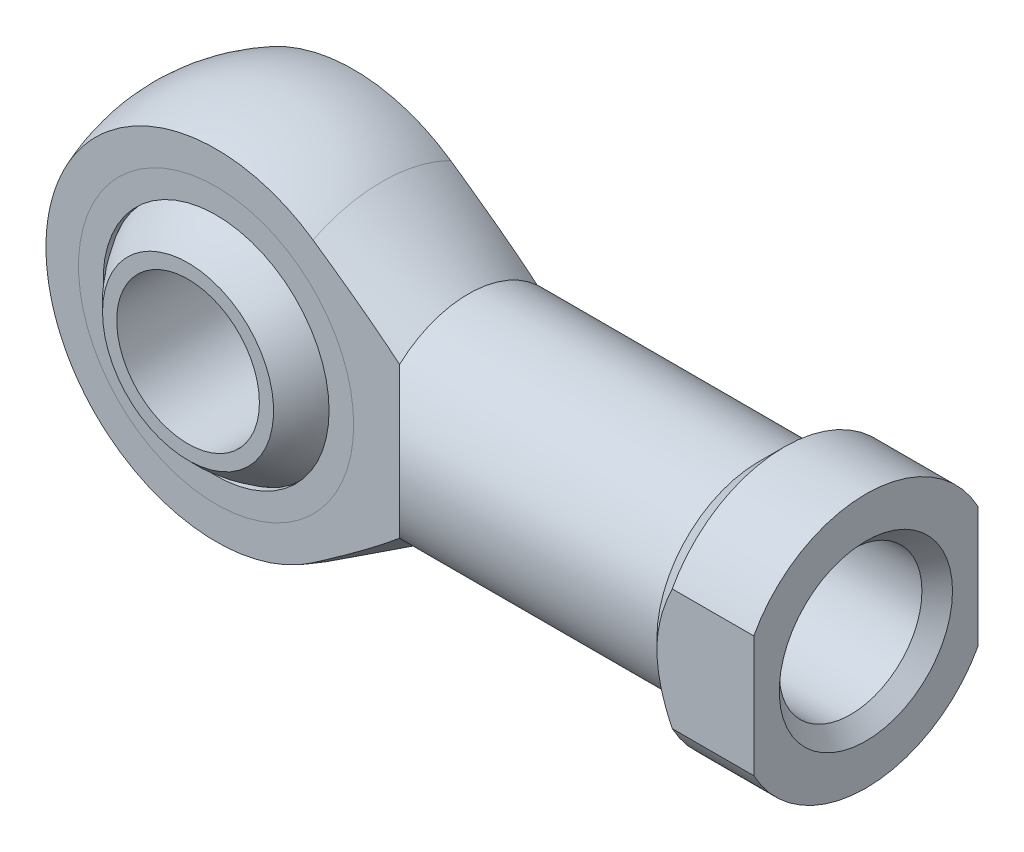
ISO-10303-21;
HEADER;
FILE_DESCRIPTION(('STEP AP214'),'2;1');
FILE_NAME('part.step','',(''),(''),'','','');
FILE_SCHEMA(('AUTOMOTIVE_DESIGN { 1 0 10303 214 1 1 1 1 }'));
ENDSEC;
DATA;
#1=APPLICATION_CONTEXT('core data for automotive mechanical design processes');
#2=APPLICATION_PROTOCOL_DEFINITION('international standard','automotive_design',2000,#1);
#3=PRODUCT_CONTEXT('',#1,'mechanical');
#4=PRODUCT('Part','Part','',(#3));
#5=PRODUCT_RELATED_PRODUCT_CATEGORY('part','',(#4));
#6=PRODUCT_DEFINITION_FORMATION('','',#4);
#7=PRODUCT_DEFINITION_CONTEXT('part definition',#1,'design');
#8=PRODUCT_DEFINITION('design','',#6,#7);
#9=PRODUCT_DEFINITION_SHAPE('','',#8);
#10=(LENGTH_UNIT() NAMED_UNIT(*) SI_UNIT(.MILLI.,.METRE.));
#11=(NAMED_UNIT(*) PLANE_ANGLE_UNIT() SI_UNIT($,.RADIAN.));
#12=(NAMED_UNIT(*) SI_UNIT($,.STERADIAN.) SOLID_ANGLE_UNIT());
#13=UNCERTAINTY_MEASURE_WITH_UNIT(LENGTH_MEASURE(1.E-05),#10,'distance_accuracy_value','');
#14=(GEOMETRIC_REPRESENTATION_CONTEXT(3) GLOBAL_UNCERTAINTY_ASSIGNED_CONTEXT((#13)) GLOBAL_UNIT_ASSIGNED_CONTEXT((#10,
#11,#12)) REPRESENTATION_CONTEXT('',''));
#15=CARTESIAN_POINT('',(0.,0.,0.));
#16=DIRECTION('',(0.,0.,1.));
#17=DIRECTION('',(1.,0.,0.));
#18=AXIS2_PLACEMENT_3D('',#15,#16,#17);
#19=CARTESIAN_POINT('',(0.,0.,0.));
#20=DIRECTION('',(0.,1.,0.));
#21=DIRECTION('',(1.,0.,0.));
#22=AXIS2_PLACEMENT_3D('',#19,#20,#21);
#23=SPHERICAL_SURFACE('',#22,12.675);
#24=CARTESIAN_POINT('',(0.,0.,0.));
#25=DIRECTION('',(0.,0.,-1.));
#26=DIRECTION('',(-1.,0.,0.));
#27=AXIS2_PLACEMENT_3D('',#24,#25,#26);
#28=SPHERICAL_SURFACE('',#27,12.675);
#29=CARTESIAN_POINT('',(0.,0.,9.5));
#30=DIRECTION('',(0.,0.,-1.));
#31=DIRECTION('',(-1.,0.,0.));
#32=AXIS2_PLACEMENT_3D('',#29,#30,#31);
#33=CIRCLE('',#32,8.39080598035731);
#34=CARTESIAN_POINT('',(-8.39080598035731,0.,9.5));
#35=VERTEX_POINT('',#34);
#36=EDGE_CURVE('P0_E26',#35,#35,#33,.F.);
#37=ORIENTED_EDGE('',*,*,#36,.F.);
#38=EDGE_LOOP('',(#37));
#39=FACE_BOUND('',#38,.T.);
#40=CARTESIAN_POINT('',(0.,0.,-9.5));
#41=DIRECTION('',(0.,0.,1.));
#42=DIRECTION('',(1.,0.,0.));
#43=AXIS2_PLACEMENT_3D('',#40,#41,#42);
#44=CIRCLE('',#43,8.39080598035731);
#45=CARTESIAN_POINT('',(8.39080598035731,0.,-9.5));
#46=VERTEX_POINT('',#45);
#47=EDGE_CURVE('P0_E10',#46,#46,#44,.F.);
#48=ORIENTED_EDGE('',*,*,#47,.F.);
#49=EDGE_LOOP('',(#48));
#50=FACE_BOUND('',#49,.T.);
#51=ADVANCED_FACE('P0_F14',(#39,#50),#28,.T.);
#52=CARTESIAN_POINT('',(0.,0.,-12.675));
#53=DIRECTION('',(0.,0.,1.));
#54=DIRECTION('',(1.,0.,0.));
#55=AXIS2_PLACEMENT_3D('',#52,#53,#54);
#56=CYLINDRICAL_SURFACE('',#55,7.);
#57=CARTESIAN_POINT('',(0.,0.,9.5));
#58=DIRECTION('',(0.,0.,-1.));
#59=DIRECTION('',(-1.,0.,0.));
#60=AXIS2_PLACEMENT_3D('',#57,#58,#59);
#61=CIRCLE('',#60,7.);
#62=CARTESIAN_POINT('',(7.,0.,9.5));
#63=VERTEX_POINT('',#62);
#64=EDGE_CURVE('P0_E17',#63,#63,#61,.F.);
#65=CARTESIAN_POINT('',(0.,0.,-9.5));
#66=DIRECTION('',(0.,0.,1.));
#67=DIRECTION('',(1.,0.,0.));
#68=AXIS2_PLACEMENT_3D('',#65,#66,#67);
#69=CIRCLE('',#68,7.);
#70=CARTESIAN_POINT('',(7.,0.,-9.5));
#71=VERTEX_POINT('',#70);
#72=EDGE_CURVE('P0_E21',#71,#71,#69,.F.);
#73=CARTESIAN_POINT('',(7.,0.,9.5));
#74=CARTESIAN_POINT('',(7.,0.,9.30208333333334));
#75=CARTESIAN_POINT('',(7.,0.,9.10416666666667));
#76=CARTESIAN_POINT('',(7.,0.,8.70833333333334));
#77=CARTESIAN_POINT('',(7.,0.,8.51041666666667));
#78=CARTESIAN_POINT('',(7.,0.,8.11458333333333));
#79=CARTESIAN_POINT('',(7.,0.,7.91666666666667));
#80=CARTESIAN_POINT('',(7.,0.,7.52083333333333));
#81=CARTESIAN_POINT('',(7.,0.,7.32291666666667));
#82=CARTESIAN_POINT('',(7.,0.,6.92708333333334));
#83=CARTESIAN_POINT('',(7.,0.,6.72916666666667));
#84=CARTESIAN_POINT('',(7.,0.,6.33333333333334));
#85=CARTESIAN_POINT('',(7.,0.,6.13541666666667));
#86=CARTESIAN_POINT('',(7.,0.,5.73958333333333));
#87=CARTESIAN_POINT('',(7.,0.,5.54166666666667));
#88=CARTESIAN_POINT('',(7.,0.,5.14583333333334));
#89=CARTESIAN_POINT('',(7.,0.,4.94791666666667));
#90=CARTESIAN_POINT('',(7.,0.,4.55208333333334));
#91=CARTESIAN_POINT('',(7.,0.,4.35416666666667));
#92=CARTESIAN_POINT('',(7.,0.,3.95833333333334));
#93=CARTESIAN_POINT('',(7.,0.,3.76041666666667));
#94=CARTESIAN_POINT('',(7.,0.,3.36458333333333));
#95=CARTESIAN_POINT('',(7.,0.,3.16666666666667));
#96=CARTESIAN_POINT('',(7.,0.,2.77083333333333));
#97=CARTESIAN_POINT('',(7.,0.,2.57291666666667));
#98=CARTESIAN_POINT('',(7.,0.,2.17708333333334));
#99=CARTESIAN_POINT('',(7.,0.,1.97916666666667));
#100=CARTESIAN_POINT('',(7.,0.,1.58333333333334));
#101=CARTESIAN_POINT('',(7.,0.,1.38541666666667));
#102=CARTESIAN_POINT('',(7.,0.,0.989583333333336));
#103=CARTESIAN_POINT('',(7.,0.,0.791666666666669));
#104=CARTESIAN_POINT('',(7.,0.,0.395833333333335));
#105=CARTESIAN_POINT('',(7.,0.,0.197916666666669));
#106=CARTESIAN_POINT('',(7.,0.,-0.197916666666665));
#107=CARTESIAN_POINT('',(7.,0.,-0.395833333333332));
#108=CARTESIAN_POINT('',(7.,0.,-0.791666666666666));
#109=CARTESIAN_POINT('',(7.,0.,-0.989583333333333));
#110=CARTESIAN_POINT('',(7.,0.,-1.38541666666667));
#111=CARTESIAN_POINT('',(7.,0.,-1.58333333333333));
#112=CARTESIAN_POINT('',(7.,0.,-1.97916666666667));
#113=CARTESIAN_POINT('',(7.,0.,-2.17708333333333));
#114=CARTESIAN_POINT('',(7.,0.,-2.57291666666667));
#115=CARTESIAN_POINT('',(7.,0.,-2.77083333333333));
#116=CARTESIAN_POINT('',(7.,0.,-3.16666666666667));
#117=CARTESIAN_POINT('',(7.,0.,-3.36458333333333));
#118=CARTESIAN_POINT('',(7.,0.,-3.76041666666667));
#119=CARTESIAN_POINT('',(7.,0.,-3.95833333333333));
#120=CARTESIAN_POINT('',(7.,0.,-4.35416666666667));
#121=CARTESIAN_POINT('',(7.,0.,-4.55208333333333));
#122=CARTESIAN_POINT('',(7.,0.,-4.94791666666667));
#123=CARTESIAN_POINT('',(7.,0.,-5.14583333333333));
#124=CARTESIAN_POINT('',(7.,0.,-5.54166666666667));
#125=CARTESIAN_POINT('',(7.,0.,-5.73958333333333));
#126=CARTESIAN_POINT('',(7.,0.,-6.13541666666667));
#127=CARTESIAN_POINT('',(7.,0.,-6.33333333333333));
#128=CARTESIAN_POINT('',(7.,0.,-6.72916666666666));
#129=CARTESIAN_POINT('',(7.,0.,-6.92708333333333));
#130=CARTESIAN_POINT('',(7.,0.,-7.32291666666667));
#131=CARTESIAN_POINT('',(7.,0.,-7.52083333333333));
#132=CARTESIAN_POINT('',(7.,0.,-7.91666666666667));
#133=CARTESIAN_POINT('',(7.,0.,-8.11458333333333));
#134=CARTESIAN_POINT('',(7.,0.,-8.51041666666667));
#135=CARTESIAN_POINT('',(7.,0.,-8.70833333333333));
#136=CARTESIAN_POINT('',(7.,0.,-9.10416666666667));
#137=CARTESIAN_POINT('',(7.,0.,-9.30208333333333));
#138=CARTESIAN_POINT('',(7.,0.,-9.5));
#139=B_SPLINE_CURVE_WITH_KNOTS('',3,(#73,#74,#75,#76,#77,#78,#79,#80,#81,#82,#83,#84,#85,#86,
#87,#88,#89,#90,#91,#92,#93,#94,#95,#96,#97,#98,#99,#100,#101,#102,#103,#104,#105,#106,#107,
#108,#109,#110,#111,#112,#113,#114,#115,#116,#117,#118,#119,#120,#121,#122,#123,#124,#125,#126,
#127,#128,#129,#130,#131,#132,#133,#134,#135,#136,#137,#138),.UNSPECIFIED.,.F.,.F.,(4,2,2,2,2,2,
2,2,2,2,2,2,2,2,2,2,2,2,2,2,2,2,2,2,2,2,2,2,2,2,2,2,4),(0.,0.593750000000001,1.1875,1.78125,
2.375,2.96875,3.5625,4.15625,4.75,5.34375,5.9375,6.53125,7.125,7.71875,8.3125,8.90625,9.5,
10.09375,10.6875,11.28125,11.875,12.46875,13.0625,13.65625,14.25,14.84375,15.4375,16.03125,
16.625,17.21875,17.8125,18.40625,19.),.UNSPECIFIED.);
#140=EDGE_CURVE('P0_BSEAM34',#63,#71,#139,.T.);
#141=ORIENTED_EDGE('',*,*,#64,.T.);
#142=ORIENTED_EDGE('',*,*,#72,.T.);
#143=ORIENTED_EDGE('',*,*,#140,.T.);
#144=ORIENTED_EDGE('',*,*,#140,.F.);
#145=EDGE_LOOP('',(#141,#143,#142,#144));
#146=FACE_BOUND('',#145,.T.);
#147=ADVANCED_FACE('P0_F34',(#146),#56,.F.);
#148=CARTESIAN_POINT('',(-12.675,-12.675,-9.5));
#149=DIRECTION('',(0.,0.,1.));
#150=DIRECTION('',(1.,0.,0.));
#151=AXIS2_PLACEMENT_3D('',#148,#149,#150);
#152=PLANE('',#151);
#153=ORIENTED_EDGE('',*,*,#47,.T.);
#154=EDGE_LOOP('',(#153));
#155=FACE_BOUND('',#154,.T.);
#156=ORIENTED_EDGE('',*,*,#72,.F.);
#157=EDGE_LOOP('',(#156));
#158=FACE_BOUND('',#157,.T.);
#159=ADVANCED_FACE('P0_F39',(#155,#158),#152,.F.);
#160=CARTESIAN_POINT('',(-12.675,-12.675,9.5));
#161=DIRECTION('',(0.,0.,-1.));
#162=DIRECTION('',(-1.,0.,0.));
#163=AXIS2_PLACEMENT_3D('',#160,#161,#162);
#164=PLANE('',#163);
#165=ORIENTED_EDGE('',*,*,#36,.T.);
#166=EDGE_LOOP('',(#165));
#167=FACE_BOUND('',#166,.T.);
#168=ORIENTED_EDGE('',*,*,#64,.F.);
#169=EDGE_LOOP('',(#168));
#170=FACE_BOUND('',#169,.T.);
#171=ADVANCED_FACE('P0_F37',(#167,#170),#164,.F.);
#172=CLOSED_SHELL('',(#51,#147,#159,#171));
#173=MANIFOLD_SOLID_BREP('P0_B1',#172);
#174=CARTESIAN_POINT('',(0.,0.,6.75));
#175=DIRECTION('',(0.,0.,1.));
#176=DIRECTION('',(1.,0.,0.));
#177=AXIS2_PLACEMENT_3D('',#174,#175,#176);
#178=PLANE('',#177);
#179=CARTESIAN_POINT('',(0.,0.,6.75));
#180=DIRECTION('',(0.,0.,1.));
#181=DIRECTION('',(1.,0.,0.));
#182=AXIS2_PLACEMENT_3D('',#179,#180,#181);
#183=CIRCLE('',#182,13.5);
#184=CARTESIAN_POINT('',(13.5,0.,6.75));
#185=VERTEX_POINT('',#184);
#186=EDGE_CURVE('P1_E10',#185,#185,#183,.T.);
#187=ORIENTED_EDGE('',*,*,#186,.T.);
#188=EDGE_LOOP('',(#187));
#189=FACE_BOUND('',#188,.T.);
#190=CARTESIAN_POINT('',(0.,0.,6.75));
#191=DIRECTION('',(0.,0.,1.));
#192=DIRECTION('',(1.,0.,0.));
#193=AXIS2_PLACEMENT_3D('',#190,#191,#192);
#194=CIRCLE('',#193,11.085);
#195=CARTESIAN_POINT('',(11.085,0.,6.75));
#196=VERTEX_POINT('',#195);
#197=EDGE_CURVE('P1_E25',#196,#196,#194,.T.);
#198=ORIENTED_EDGE('',*,*,#197,.F.);
#199=EDGE_LOOP('',(#198));
#200=FACE_BOUND('',#199,.T.);
#201=ADVANCED_FACE('P1_F14',(#189,#200),#178,.T.);
#202=CARTESIAN_POINT('',(0.,0.,6.15));
#203=DIRECTION('',(0.,0.,1.));
#204=DIRECTION('',(1.,0.,0.));
#205=AXIS2_PLACEMENT_3D('',#202,#203,#204);
#206=PLANE('',#205);
#207=CARTESIAN_POINT('',(0.,0.,6.15));
#208=DIRECTION('',(0.,0.,1.));
#209=DIRECTION('',(1.,0.,0.));
#210=AXIS2_PLACEMENT_3D('',#207,#208,#209);
#211=CIRCLE('',#210,13.5);
#212=CARTESIAN_POINT('',(13.5,0.,6.15));
#213=VERTEX_POINT('',#212);
#214=EDGE_CURVE('P1_E18',#213,#213,#211,.T.);
#215=ORIENTED_EDGE('',*,*,#214,.F.);
#216=EDGE_LOOP('',(#215));
#217=FACE_BOUND('',#216,.T.);
#218=CARTESIAN_POINT('',(0.,0.,6.15));
#219=DIRECTION('',(0.,0.,1.));
#220=DIRECTION('',(1.,0.,0.));
#221=AXIS2_PLACEMENT_3D('',#218,#219,#220);
#222=CIRCLE('',#221,11.085);
#223=CARTESIAN_POINT('',(11.085,0.,6.15));
#224=VERTEX_POINT('',#223);
#225=EDGE_CURVE('P1_E27',#224,#224,#222,.T.);
#226=ORIENTED_EDGE('',*,*,#225,.T.);
#227=EDGE_LOOP('',(#226));
#228=FACE_BOUND('',#227,.T.);
#229=ADVANCED_FACE('P1_F37',(#217,#228),#206,.F.);
#230=CARTESIAN_POINT('',(0.,0.,6.75));
#231=DIRECTION('',(0.,0.,-1.));
#232=DIRECTION('',(-1.,0.,0.));
#233=AXIS2_PLACEMENT_3D('',#230,#231,#232);
#234=CYLINDRICAL_SURFACE('',#233,13.5);
#235=ORIENTED_EDGE('',*,*,#186,.F.);
#236=EDGE_LOOP('',(#235));
#237=FACE_BOUND('',#236,.T.);
#238=ORIENTED_EDGE('',*,*,#214,.T.);
#239=EDGE_LOOP('',(#238));
#240=FACE_BOUND('',#239,.T.);
#241=ADVANCED_FACE('P1_F16',(#237,#240),#234,.T.);
#242=CARTESIAN_POINT('',(0.,0.,6.75));
#243=DIRECTION('',(0.,0.,-1.));
#244=DIRECTION('',(-1.,0.,0.));
#245=AXIS2_PLACEMENT_3D('',#242,#243,#244);
#246=CYLINDRICAL_SURFACE('',#245,11.085);
#247=ORIENTED_EDGE('',*,*,#197,.T.);
#248=EDGE_LOOP('',(#247));
#249=FACE_BOUND('',#248,.T.);
#250=ORIENTED_EDGE('',*,*,#225,.F.);
#251=EDGE_LOOP('',(#250));
#252=FACE_BOUND('',#251,.T.);
#253=ADVANCED_FACE('P1_F33',(#249,#252),#246,.F.);
#254=CLOSED_SHELL('',(#201,#229,#241,#253));
#255=MANIFOLD_SOLID_BREP('P1_B1',#254);
#256=CARTESIAN_POINT('',(0.,0.,-6.15));
#257=DIRECTION('',(0.,0.,1.));
#258=DIRECTION('',(1.,0.,0.));
#259=AXIS2_PLACEMENT_3D('',#256,#257,#258);
#260=PLANE('',#259);
#261=CARTESIAN_POINT('',(0.,0.,-6.15));
#262=DIRECTION('',(0.,0.,1.));
#263=DIRECTION('',(1.,0.,0.));
#264=AXIS2_PLACEMENT_3D('',#261,#262,#263);
#265=CIRCLE('',#264,13.5);
#266=CARTESIAN_POINT('',(13.5,0.,-6.15));
#267=VERTEX_POINT('',#266);
#268=EDGE_CURVE('P2_E10',#267,#267,#265,.T.);
#269=ORIENTED_EDGE('',*,*,#268,.T.);
#270=EDGE_LOOP('',(#269));
#271=FACE_BOUND('',#270,.T.);
#272=CARTESIAN_POINT('',(0.,0.,-6.15));
#273=DIRECTION('',(0.,0.,1.));
#274=DIRECTION('',(1.,0.,0.));
#275=AXIS2_PLACEMENT_3D('',#272,#273,#274);
#276=CIRCLE('',#275,11.085);
#277=CARTESIAN_POINT('',(11.085,0.,-6.15));
#278=VERTEX_POINT('',#277);
#279=EDGE_CURVE('P2_E25',#278,#278,#276,.T.);
#280=ORIENTED_EDGE('',*,*,#279,.F.);
#281=EDGE_LOOP('',(#280));
#282=FACE_BOUND('',#281,.T.);
#283=ADVANCED_FACE('P2_F14',(#271,#282),#260,.T.);
#284=CARTESIAN_POINT('',(0.,0.,-6.75));
#285=DIRECTION('',(0.,0.,1.));
#286=DIRECTION('',(1.,0.,0.));
#287=AXIS2_PLACEMENT_3D('',#284,#285,#286);
#288=PLANE('',#287);
#289=CARTESIAN_POINT('',(0.,0.,-6.75));
#290=DIRECTION('',(0.,0.,1.));
#291=DIRECTION('',(1.,0.,0.));
#292=AXIS2_PLACEMENT_3D('',#289,#290,#291);
#293=CIRCLE('',#292,13.5);
#294=CARTESIAN_POINT('',(13.5,0.,-6.75));
#295=VERTEX_POINT('',#294);
#296=EDGE_CURVE('P2_E18',#295,#295,#293,.T.);
#297=ORIENTED_EDGE('',*,*,#296,.F.);
#298=EDGE_LOOP('',(#297));
#299=FACE_BOUND('',#298,.T.);
#300=CARTESIAN_POINT('',(0.,0.,-6.75));
#301=DIRECTION('',(0.,0.,1.));
#302=DIRECTION('',(1.,0.,0.));
#303=AXIS2_PLACEMENT_3D('',#300,#301,#302);
#304=CIRCLE('',#303,11.085);
#305=CARTESIAN_POINT('',(11.085,0.,-6.75));
#306=VERTEX_POINT('',#305);
#307=EDGE_CURVE('P2_E27',#306,#306,#304,.T.);
#308=ORIENTED_EDGE('',*,*,#307,.T.);
#309=EDGE_LOOP('',(#308));
#310=FACE_BOUND('',#309,.T.);
#311=ADVANCED_FACE('P2_F37',(#299,#310),#288,.F.);
#312=CARTESIAN_POINT('',(0.,0.,-6.15));
#313=DIRECTION('',(0.,0.,-1.));
#314=DIRECTION('',(-1.,0.,0.));
#315=AXIS2_PLACEMENT_3D('',#312,#313,#314);
#316=CYLINDRICAL_SURFACE('',#315,13.5);
#317=ORIENTED_EDGE('',*,*,#268,.F.);
#318=EDGE_LOOP('',(#317));
#319=FACE_BOUND('',#318,.T.);
#320=ORIENTED_EDGE('',*,*,#296,.T.);
#321=EDGE_LOOP('',(#320));
#322=FACE_BOUND('',#321,.T.);
#323=ADVANCED_FACE('P2_F16',(#319,#322),#316,.T.);
#324=CARTESIAN_POINT('',(0.,0.,-6.15));
#325=DIRECTION('',(0.,0.,-1.));
#326=DIRECTION('',(-1.,0.,0.));
#327=AXIS2_PLACEMENT_3D('',#324,#325,#326);
#328=CYLINDRICAL_SURFACE('',#327,11.085);
#329=ORIENTED_EDGE('',*,*,#279,.T.);
#330=EDGE_LOOP('',(#329));
#331=FACE_BOUND('',#330,.T.);
#332=ORIENTED_EDGE('',*,*,#307,.F.);
#333=EDGE_LOOP('',(#332));
#334=FACE_BOUND('',#333,.T.);
#335=ADVANCED_FACE('P2_F33',(#331,#334),#328,.F.);
#336=CLOSED_SHELL('',(#283,#311,#323,#335));
#337=MANIFOLD_SOLID_BREP('P2_B1',#336);
#338=CARTESIAN_POINT('',(0.,0.,0.));
#339=DIRECTION('',(0.,1.,0.));
#340=DIRECTION('',(1.,0.,0.));
#341=AXIS2_PLACEMENT_3D('',#338,#339,#340);
#342=SPHERICAL_SURFACE('',#341,12.675);
#343=CARTESIAN_POINT('',(0.,0.,0.));
#344=DIRECTION('',(0.,0.,1.));
#345=DIRECTION('',(1.,0.,0.));
#346=AXIS2_PLACEMENT_3D('',#343,#344,#345);
#347=SPHERICAL_SURFACE('',#346,12.675);
#348=CARTESIAN_POINT('',(0.,0.,6.15));
#349=DIRECTION('',(0.,0.,1.));
#350=DIRECTION('',(1.,0.,0.));
#351=AXIS2_PLACEMENT_3D('',#348,#349,#350);
#352=CIRCLE('',#351,11.0830106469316);
#353=CARTESIAN_POINT('',(11.0830106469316,0.,6.15));
#354=VERTEX_POINT('',#353);
#355=EDGE_CURVE('P3_E73',#354,#354,#352,.F.);
#356=ORIENTED_EDGE('',*,*,#355,.F.);
#357=EDGE_LOOP('',(#356));
#358=FACE_BOUND('',#357,.T.);
#359=CARTESIAN_POINT('',(0.,0.,-6.15));
#360=DIRECTION('',(0.,0.,-1.));
#361=DIRECTION('',(-1.,0.,0.));
#362=AXIS2_PLACEMENT_3D('',#359,#360,#361);
#363=CIRCLE('',#362,11.0830106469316);
#364=CARTESIAN_POINT('',(-11.0830106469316,0.,-6.15));
#365=VERTEX_POINT('',#364);
#366=EDGE_CURVE('P3_E20',#365,#365,#363,.F.);
#367=ORIENTED_EDGE('',*,*,#366,.F.);
#368=EDGE_LOOP('',(#367));
#369=FACE_BOUND('',#368,.T.);
#370=ADVANCED_FACE('P3_F16',(#358,#369),#347,.F.);
#371=CARTESIAN_POINT('',(-18.,-18.,-6.75));
#372=DIRECTION('',(0.,0.,1.));
#373=DIRECTION('',(1.,0.,0.));
#374=AXIS2_PLACEMENT_3D('',#371,#372,#373);
#375=PLANE('',#374);
#376=CARTESIAN_POINT('',(0.,0.,-6.75));
#377=DIRECTION('',(0.,0.,1.));
#378=DIRECTION('',(1.,0.,0.));
#379=AXIS2_PLACEMENT_3D('',#376,#377,#378);
#380=CIRCLE('',#379,16.6864465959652);
#381=CARTESIAN_POINT('',(9.50943396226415,13.7116069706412,-6.75));
#382=VERTEX_POINT('',#381);
#383=CARTESIAN_POINT('',(9.50943396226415,-13.7116069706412,-6.75));
#384=VERTEX_POINT('',#383);
#385=EDGE_CURVE('P3_E11',#382,#384,#380,.T.);
#386=ORIENTED_EDGE('',*,*,#385,.F.);
#387=CARTESIAN_POINT('',(-9.52478964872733,-26.2733028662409,-6.75));
#388=CARTESIAN_POINT('',(-8.98435903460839,-25.926112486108,-6.75));
#389=CARTESIAN_POINT('',(-8.44412015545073,-25.5786237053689,-6.75));
#390=CARTESIAN_POINT('',(-7.36407993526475,-24.8829655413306,-6.75));
#391=CARTESIAN_POINT('',(-6.82427859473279,-24.5347961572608,-6.75));
#392=CARTESIAN_POINT('',(-5.20527120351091,-23.4889212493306,-6.75));
#393=CARTESIAN_POINT('',(-4.12680502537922,-22.7900693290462,-6.75));
#394=CARTESIAN_POINT('',(-1.96316346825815,-21.3823508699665,-6.75));
#395=CARTESIAN_POINT('',(-0.878010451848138,-20.6734499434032,-6.75));
#396=CARTESIAN_POINT('',(1.28842987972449,-19.2504734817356,-6.75));
#397=CARTESIAN_POINT('',(2.36971827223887,-18.536399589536,-6.75));
#398=CARTESIAN_POINT('',(4.14656505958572,-17.3541249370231,-6.75));
#399=CARTESIAN_POINT('',(4.84356854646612,-16.8880968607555,-6.75));
#400=CARTESIAN_POINT('',(6.23491185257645,-15.9520827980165,-6.75));
#401=CARTESIAN_POINT('',(6.92925168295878,-15.4820968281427,-6.75));
#402=CARTESIAN_POINT('',(8.31519899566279,-14.5365394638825,-6.75));
#403=CARTESIAN_POINT('',(9.0068028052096,-14.0609626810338,-6.75));
#404=CARTESIAN_POINT('',(10.3853177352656,-13.1031481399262,-6.75));
#405=CARTESIAN_POINT('',(11.0722292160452,-12.6209109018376,-6.75));
#406=CARTESIAN_POINT('',(12.0957780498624,-11.8921123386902,-6.75));
#407=CARTESIAN_POINT('',(12.43485741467,-11.64898058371,-6.75));
#408=CARTESIAN_POINT('',(13.1110831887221,-11.1600454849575,-6.75));
#409=CARTESIAN_POINT('',(13.4482296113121,-10.9142421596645,-6.75));
#410=CARTESIAN_POINT('',(14.1202972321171,-10.4193730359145,-6.75));
#411=CARTESIAN_POINT('',(14.4552176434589,-10.1703061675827,-6.75));
#412=CARTESIAN_POINT('',(15.122172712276,-9.66834184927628,-6.75));
#413=CARTESIAN_POINT('',(15.4542074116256,-9.41544445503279,-6.75));
#414=CARTESIAN_POINT('',(16.1140521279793,-8.90544671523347,-6.75));
#415=CARTESIAN_POINT('',(16.4418688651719,-8.64835508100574,-6.75));
#416=CARTESIAN_POINT('',(17.0929309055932,-8.12838331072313,-6.75));
#417=CARTESIAN_POINT('',(17.4161758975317,-7.86550278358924,-6.75));
#418=CARTESIAN_POINT('',(18.0564464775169,-7.33263930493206,-6.75));
#419=CARTESIAN_POINT('',(18.3734756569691,-7.06266067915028,-6.75));
#420=CARTESIAN_POINT('',(18.9993877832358,-6.51344541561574,-6.75));
#421=CARTESIAN_POINT('',(19.308272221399,-6.23421049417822,-6.75));
#422=CARTESIAN_POINT('',(19.6799447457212,-5.88442703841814,-6.75));
#423=CARTESIAN_POINT('',(19.7481677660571,-5.81963662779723,-6.75));
#424=CARTESIAN_POINT('',(19.8839744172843,-5.68938656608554,-6.75));
#425=CARTESIAN_POINT('',(19.951558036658,-5.62392690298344,-6.75));
#426=CARTESIAN_POINT('',(20.1532788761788,-5.42647090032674,-6.75));
#427=CARTESIAN_POINT('',(20.286375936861,-5.2934070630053,-6.75));
#428=CARTESIAN_POINT('',(20.5493885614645,-5.02389854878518,-6.75));
#429=CARTESIAN_POINT('',(20.6793007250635,-4.88745054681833,-6.75));
#430=CARTESIAN_POINT('',(20.9351102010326,-4.61083732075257,-6.75));
#431=CARTESIAN_POINT('',(21.0610076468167,-4.47067222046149,-6.75));
#432=CARTESIAN_POINT('',(21.3060450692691,-4.18821768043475,-6.75));
#433=CARTESIAN_POINT('',(21.4252582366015,-4.04599197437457,-6.75));
#434=CARTESIAN_POINT('',(21.6578155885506,-3.75682670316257,-6.75));
#435=CARTESIAN_POINT('',(21.7711605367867,-3.60988775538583,-6.75));
#436=CARTESIAN_POINT('',(21.9903953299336,-3.31085815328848,-6.75));
#437=CARTESIAN_POINT('',(22.0962960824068,-3.15877554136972,-6.75));
#438=CARTESIAN_POINT('',(22.2989291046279,-2.84865066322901,-6.75));
#439=CARTESIAN_POINT('',(22.3956652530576,-2.69061095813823,-6.75));
#440=CARTESIAN_POINT('',(22.5575664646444,-2.40350797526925,-6.75));
#441=CARTESIAN_POINT('',(22.6249936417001,-2.27572451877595,-6.75));
#442=CARTESIAN_POINT('',(22.7514423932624,-2.01602669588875,-6.75));
#443=CARTESIAN_POINT('',(22.8104638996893,-1.88411229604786,-6.75));
#444=CARTESIAN_POINT('',(22.9183930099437,-1.61653857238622,-6.75));
#445=CARTESIAN_POINT('',(22.9673243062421,-1.48088888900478,-6.75));
#446=CARTESIAN_POINT('',(23.0535669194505,-1.20595595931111,-6.75));
#447=CARTESIAN_POINT('',(23.0908830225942,-1.06667423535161,-6.75));
#448=CARTESIAN_POINT('',(23.1475626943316,-0.807180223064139,-6.75));
#449=CARTESIAN_POINT('',(23.1688185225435,-0.687381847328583,-6.75));
#450=CARTESIAN_POINT('',(23.2012258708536,-0.446422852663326,-6.75));
#451=CARTESIAN_POINT('',(23.2123785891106,-0.325262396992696,-6.75));
#452=CARTESIAN_POINT('',(23.2241628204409,-0.0823430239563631,-6.75));
#453=CARTESIAN_POINT('',(23.2247871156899,0.0394162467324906,-6.75));
#454=CARTESIAN_POINT('',(23.2154727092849,0.282530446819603,-6.75));
#455=CARTESIAN_POINT('',(23.2055335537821,0.403885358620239,-6.75));
#456=CARTESIAN_POINT('',(23.175529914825,0.644822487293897,-6.75));
#457=CARTESIAN_POINT('',(23.1555070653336,0.764409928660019,-6.75));
#458=CARTESIAN_POINT('',(23.1060576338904,1.00164334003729,-6.75));
#459=CARTESIAN_POINT('',(23.0766271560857,1.1192884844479,-6.75));
#460=CARTESIAN_POINT('',(22.9755768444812,1.46840168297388,-6.75));
#461=CARTESIAN_POINT('',(22.8911739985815,1.69622354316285,-6.75));
#462=CARTESIAN_POINT('',(22.7031915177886,2.12424015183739,-6.75));
#463=CARTESIAN_POINT('',(22.6013948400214,2.32524858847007,-6.75));
#464=CARTESIAN_POINT('',(22.3806525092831,2.71775015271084,-6.75));
#465=CARTESIAN_POINT('',(22.2616910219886,2.90923427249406,-6.75));
#466=CARTESIAN_POINT('',(22.0102729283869,3.28444122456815,-6.75));
#467=CARTESIAN_POINT('',(21.877750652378,3.46811954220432,-6.75));
#468=CARTESIAN_POINT('',(21.6716125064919,3.73788154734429,-6.75));
#469=CARTESIAN_POINT('',(21.6016877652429,3.82682687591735,-6.75));
#470=CARTESIAN_POINT('',(21.4596652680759,4.00296488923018,-6.75));
#471=CARTESIAN_POINT('',(21.387567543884,4.09015759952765,-6.75));
#472=CARTESIAN_POINT('',(21.1710471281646,4.34620936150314,-6.75));
#473=CARTESIAN_POINT('',(21.0239017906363,4.51276887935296,-6.75));
#474=CARTESIAN_POINT('',(20.72382893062,4.8406134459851,-6.75));
#475=CARTESIAN_POINT('',(20.5709003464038,5.00189751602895,-6.75));
#476=CARTESIAN_POINT('',(20.2603321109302,5.3200514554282,-6.75));
#477=CARTESIAN_POINT('',(20.1026895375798,5.47691846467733,-6.75));
#478=CARTESIAN_POINT('',(19.7836417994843,5.78678595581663,-6.75));
#479=CARTESIAN_POINT('',(19.6222363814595,5.93978617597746,-6.75));
#480=CARTESIAN_POINT('',(19.132657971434,6.39451681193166,-6.75));
#481=CARTESIAN_POINT('',(18.7998441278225,6.69125043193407,-6.75));
#482=CARTESIAN_POINT('',(18.1255793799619,7.2747369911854,-6.75));
#483=CARTESIAN_POINT('',(17.7841273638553,7.56148863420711,-6.75));
#484=CARTESIAN_POINT('',(17.265930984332,7.98685076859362,-6.75));
#485=CARTESIAN_POINT('',(17.091547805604,8.12835185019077,-6.75));
#486=CARTESIAN_POINT('',(16.7413930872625,8.40960011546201,-6.75));
#487=CARTESIAN_POINT('',(16.565621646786,8.54934742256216,-6.75));
#488=CARTESIAN_POINT('',(16.0364503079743,8.96630586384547,-6.75));
#489=CARTESIAN_POINT('',(15.6812281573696,9.2412051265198,-6.75));
#490=CARTESIAN_POINT('',(14.967628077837,9.78562494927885,-6.75));
#491=CARTESIAN_POINT('',(14.6092563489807,10.0551536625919,-6.75));
#492=CARTESIAN_POINT('',(13.8895556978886,10.5902068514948,-6.75));
#493=CARTESIAN_POINT('',(13.5282268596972,10.8557314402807,-6.75));
#494=CARTESIAN_POINT('',(12.6967033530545,11.4609936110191,-6.75));
#495=CARTESIAN_POINT('',(12.2257030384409,11.7996233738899,-6.75));
#496=CARTESIAN_POINT('',(11.2805966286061,12.4725250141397,-6.75));
#497=CARTESIAN_POINT('',(10.8064904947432,12.8067968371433,-6.75));
#498=CARTESIAN_POINT('',(9.85579291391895,13.471835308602,-6.75));
#499=CARTESIAN_POINT('',(9.37920134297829,13.8026017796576,-6.75));
#500=CARTESIAN_POINT('',(8.4240248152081,14.4612455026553,-6.75));
#501=CARTESIAN_POINT('',(7.94543984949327,14.7891227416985,-6.75));
#502=CARTESIAN_POINT('',(6.5063997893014,15.7697638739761,-6.75));
#503=CARTESIAN_POINT('',(5.54350567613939,16.418948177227,-6.75));
#504=CARTESIAN_POINT('',(3.6132306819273,17.7105358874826,-6.75));
#505=CARTESIAN_POINT('',(2.64584992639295,18.3529394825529,-6.75));
#506=CARTESIAN_POINT('',(0.747218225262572,19.6066978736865,-6.75));
#507=CARTESIAN_POINT('',(-0.183900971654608,20.2182523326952,-6.75));
#508=CARTESIAN_POINT('',(-2.04846246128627,21.4378253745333,-6.75));
#509=CARTESIAN_POINT('',(-2.98190477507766,22.0458439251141,-6.75));
#510=CARTESIAN_POINT('',(-4.84944799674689,23.2583674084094,-6.75));
#511=CARTESIAN_POINT('',(-5.78354670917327,23.8628757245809,-6.75));
#512=CARTESIAN_POINT('',(-7.65317713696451,25.0696428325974,-6.75));
#513=CARTESIAN_POINT('',(-8.58870883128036,25.6719016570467,-6.75));
#514=CARTESIAN_POINT('',(-9.52478964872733,26.2733028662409,-6.75));
#515=B_SPLINE_CURVE_WITH_KNOTS('',3,(#387,#388,#389,#390,#391,#392,#393,#394,#395,#396,#397,
#398,#399,#400,#401,#402,#403,#404,#405,#406,#407,#408,#409,#410,#411,#412,#413,#414,#415,#416,
#417,#418,#419,#420,#421,#422,#423,#424,#425,#426,#427,#428,#429,#430,#431,#432,#433,#434,#435,
#436,#437,#438,#439,#440,#441,#442,#443,#444,#445,#446,#447,#448,#449,#450,#451,#452,#453,#454,
#455,#456,#457,#458,#459,#460,#461,#462,#463,#464,#465,#466,#467,#468,#469,#470,#471,#472,#473,
#474,#475,#476,#477,#478,#479,#480,#481,#482,#483,#484,#485,#486,#487,#488,#489,#490,#491,#492,
#493,#494,#495,#496,#497,#498,#499,#500,#501,#502,#503,#504,#505,#506,#507,#508,#509,#510,#511,
#512,#513,#514),.UNSPECIFIED.,.F.,.F.,(4,2,2,2,2,2,2,2,2,2,2,2,2,2,2,2,2,2,2,2,2,2,2,2,2,2,2,2,
2,2,2,2,2,2,2,2,2,2,2,2,2,2,2,2,2,2,2,2,2,2,2,2,2,2,2,2,2,2,2,2,2,2,2,4),(0.,1.92703316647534,
3.85406851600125,7.70936287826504,11.5979096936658,15.485271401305,18.0006072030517,
20.5159324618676,23.0339217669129,25.5517155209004,26.8034205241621,28.055116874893,
29.3072343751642,30.5593336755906,31.8090994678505,33.0589499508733,34.3080556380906,
35.5569309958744,35.8391854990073,36.1214450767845,36.6860059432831,37.251145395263,
37.816266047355,38.3728803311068,38.9294220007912,39.4851304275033,40.0406026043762,
40.4737954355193,40.9069917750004,41.3391590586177,41.7711480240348,42.1357611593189,
42.5003310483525,42.8651508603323,43.2299863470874,43.593327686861,43.9568196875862,
44.6832761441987,45.358249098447,46.0338487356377,46.7128905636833,47.0522845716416,
47.3916736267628,48.0582260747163,48.7249014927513,49.3919991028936,50.0591417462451,
51.3964962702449,52.7340238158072,53.407726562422,54.0813816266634,55.428826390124,
56.7740397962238,58.119215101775,59.8594701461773,61.599746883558,63.3401112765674,
65.0804834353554,68.564320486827,72.0480606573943,75.3900309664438,78.7320317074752,
82.0699522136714,85.4078241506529),.UNSPECIFIED.);
#516=CARTESIAN_POINT('',(18.,7.37817728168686,-6.75));
#517=VERTEX_POINT('',#516);
#518=EDGE_CURVE('P3_E102',#517,#382,#515,.T.);
#519=ORIENTED_EDGE('',*,*,#518,.F.);
#520=DIRECTION('',(0.,1.,0.));
#521=VECTOR('',#520,1.);
#522=CARTESIAN_POINT('',(18.,-18.,-6.75));
#523=LINE('',#522,#521);
#524=CARTESIAN_POINT('',(18.,-7.37817728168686,-6.75));
#525=VERTEX_POINT('',#524);
#526=EDGE_CURVE('P3_E64',#525,#517,#523,.T.);
#527=ORIENTED_EDGE('',*,*,#526,.F.);
#528=EDGE_CURVE('P3_E33',#384,#525,#515,.T.);
#529=ORIENTED_EDGE('',*,*,#528,.F.);
#530=EDGE_LOOP('',(#386,#519,#527,#529));
#531=FACE_BOUND('',#530,.T.);
#532=CARTESIAN_POINT('',(0.,0.,-6.75));
#533=DIRECTION('',(0.,0.,1.));
#534=DIRECTION('',(1.,0.,0.));
#535=AXIS2_PLACEMENT_3D('',#532,#533,#534);
#536=CIRCLE('',#535,13.5);
#537=CARTESIAN_POINT('',(13.5,0.,-6.75));
#538=VERTEX_POINT('',#537);
#539=EDGE_CURVE('P3_E95',#538,#538,#536,.T.);
#540=ORIENTED_EDGE('',*,*,#539,.T.);
#541=EDGE_LOOP('',(#540));
#542=FACE_BOUND('',#541,.T.);
#543=ADVANCED_FACE('P3_F115',(#531,#542),#375,.F.);
#544=CARTESIAN_POINT('',(18.,0.,0.));
#545=DIRECTION('',(-1.,0.,0.));
#546=DIRECTION('',(0.,0.,1.));
#547=AXIS2_PLACEMENT_3D('',#544,#545,#546);
#548=CONICAL_SURFACE('',#547,10.,0.556599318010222);
#549=CARTESIAN_POINT('',(9.50943396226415,0.,0.));
#550=DIRECTION('',(-1.,0.,0.));
#551=DIRECTION('',(0.,0.,1.));
#552=AXIS2_PLACEMENT_3D('',#549,#550,#551);
#553=CIRCLE('',#552,15.2830188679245);
#554=CARTESIAN_POINT('',(9.50943396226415,-13.7116069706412,6.75));
#555=VERTEX_POINT('',#554);
#556=EDGE_CURVE('P3_E79',#384,#555,#553,.T.);
#557=ORIENTED_EDGE('',*,*,#556,.F.);
#558=ORIENTED_EDGE('',*,*,#528,.T.);
#559=CARTESIAN_POINT('',(18.,0.,0.));
#560=DIRECTION('',(-1.,0.,0.));
#561=DIRECTION('',(0.,0.,1.));
#562=AXIS2_PLACEMENT_3D('',#559,#560,#561);
#563=CIRCLE('',#562,10.);
#564=CARTESIAN_POINT('',(18.,-7.37817728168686,6.75));
#565=VERTEX_POINT('',#564);
#566=EDGE_CURVE('P3_E70',#525,#565,#563,.T.);
#567=ORIENTED_EDGE('',*,*,#566,.T.);
#568=CARTESIAN_POINT('',(-9.52478964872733,26.2733028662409,6.75));
#569=CARTESIAN_POINT('',(-8.98435903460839,25.926112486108,6.75));
#570=CARTESIAN_POINT('',(-8.44412015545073,25.5786237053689,6.75));
#571=CARTESIAN_POINT('',(-7.36407993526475,24.8829655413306,6.75));
#572=CARTESIAN_POINT('',(-6.82427859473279,24.5347961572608,6.75));
#573=CARTESIAN_POINT('',(-5.20527120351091,23.4889212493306,6.75));
#574=CARTESIAN_POINT('',(-4.12680502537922,22.7900693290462,6.75));
#575=CARTESIAN_POINT('',(-1.96316346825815,21.3823508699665,6.75));
#576=CARTESIAN_POINT('',(-0.878010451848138,20.6734499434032,6.75));
#577=CARTESIAN_POINT('',(1.28842987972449,19.2504734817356,6.75));
#578=CARTESIAN_POINT('',(2.36971827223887,18.536399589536,6.75));
#579=CARTESIAN_POINT('',(4.14656505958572,17.3541249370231,6.75));
#580=CARTESIAN_POINT('',(4.84356854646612,16.8880968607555,6.75));
#581=CARTESIAN_POINT('',(6.23491185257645,15.9520827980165,6.75));
#582=CARTESIAN_POINT('',(6.92925168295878,15.4820968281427,6.75));
#583=CARTESIAN_POINT('',(8.31519899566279,14.5365394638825,6.75));
#584=CARTESIAN_POINT('',(9.0068028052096,14.0609626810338,6.75));
#585=CARTESIAN_POINT('',(10.3853177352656,13.1031481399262,6.75));
#586=CARTESIAN_POINT('',(11.0722292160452,12.6209109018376,6.75));
#587=CARTESIAN_POINT('',(12.0957780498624,11.8921123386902,6.75));
#588=CARTESIAN_POINT('',(12.43485741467,11.64898058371,6.75));
#589=CARTESIAN_POINT('',(13.1110831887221,11.1600454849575,6.75));
#590=CARTESIAN_POINT('',(13.4482296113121,10.9142421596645,6.75));
#591=CARTESIAN_POINT('',(14.1202972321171,10.4193730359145,6.75));
#592=CARTESIAN_POINT('',(14.4552176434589,10.1703061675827,6.75));
#593=CARTESIAN_POINT('',(15.122172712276,9.66834184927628,6.75));
#594=CARTESIAN_POINT('',(15.4542074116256,9.41544445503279,6.75));
#595=CARTESIAN_POINT('',(16.1140521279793,8.90544671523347,6.75));
#596=CARTESIAN_POINT('',(16.4418688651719,8.64835508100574,6.75));
#597=CARTESIAN_POINT('',(17.0929309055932,8.12838331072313,6.75));
#598=CARTESIAN_POINT('',(17.4161758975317,7.86550278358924,6.75));
#599=CARTESIAN_POINT('',(18.0564464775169,7.33263930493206,6.75));
#600=CARTESIAN_POINT('',(18.3734756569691,7.06266067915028,6.75));
#601=CARTESIAN_POINT('',(18.9993877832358,6.51344541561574,6.75));
#602=CARTESIAN_POINT('',(19.308272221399,6.23421049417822,6.75));
#603=CARTESIAN_POINT('',(19.6799447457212,5.88442703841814,6.75));
#604=CARTESIAN_POINT('',(19.7481677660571,5.81963662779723,6.75));
#605=CARTESIAN_POINT('',(19.8839744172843,5.68938656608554,6.75));
#606=CARTESIAN_POINT('',(19.951558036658,5.62392690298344,6.75));
#607=CARTESIAN_POINT('',(20.1532788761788,5.42647090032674,6.75));
#608=CARTESIAN_POINT('',(20.286375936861,5.2934070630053,6.75));
#609=CARTESIAN_POINT('',(20.5493885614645,5.02389854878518,6.75));
#610=CARTESIAN_POINT('',(20.6793007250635,4.88745054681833,6.75));
#611=CARTESIAN_POINT('',(20.9351102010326,4.61083732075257,6.75));
#612=CARTESIAN_POINT('',(21.0610076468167,4.47067222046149,6.75));
#613=CARTESIAN_POINT('',(21.3060450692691,4.18821768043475,6.75));
#614=CARTESIAN_POINT('',(21.4252582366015,4.04599197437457,6.75));
#615=CARTESIAN_POINT('',(21.6578155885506,3.75682670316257,6.75));
#616=CARTESIAN_POINT('',(21.7711605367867,3.60988775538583,6.75));
#617=CARTESIAN_POINT('',(21.9903953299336,3.31085815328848,6.75));
#618=CARTESIAN_POINT('',(22.0962960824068,3.15877554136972,6.75));
#619=CARTESIAN_POINT('',(22.2989291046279,2.84865066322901,6.75));
#620=CARTESIAN_POINT('',(22.3956652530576,2.69061095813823,6.75));
#621=CARTESIAN_POINT('',(22.5575664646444,2.40350797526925,6.75));
#622=CARTESIAN_POINT('',(22.6249936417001,2.27572451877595,6.75));
#623=CARTESIAN_POINT('',(22.7514423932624,2.01602669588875,6.75));
#624=CARTESIAN_POINT('',(22.8104638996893,1.88411229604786,6.75));
#625=CARTESIAN_POINT('',(22.9183930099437,1.61653857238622,6.75));
#626=CARTESIAN_POINT('',(22.9673243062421,1.48088888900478,6.75));
#627=CARTESIAN_POINT('',(23.0535669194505,1.20595595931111,6.75));
#628=CARTESIAN_POINT('',(23.0908830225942,1.06667423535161,6.75));
#629=CARTESIAN_POINT('',(23.1475626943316,0.807180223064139,6.75));
#630=CARTESIAN_POINT('',(23.1688185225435,0.687381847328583,6.75));
#631=CARTESIAN_POINT('',(23.2012258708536,0.446422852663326,6.75));
#632=CARTESIAN_POINT('',(23.2123785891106,0.325262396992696,6.75));
#633=CARTESIAN_POINT('',(23.2241628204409,0.0823430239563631,6.75));
#634=CARTESIAN_POINT('',(23.2247871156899,-0.0394162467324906,6.75));
#635=CARTESIAN_POINT('',(23.2154727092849,-0.282530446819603,6.75));
#636=CARTESIAN_POINT('',(23.2055335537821,-0.403885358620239,6.75));
#637=CARTESIAN_POINT('',(23.175529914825,-0.644822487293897,6.75));
#638=CARTESIAN_POINT('',(23.1555070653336,-0.764409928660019,6.75));
#639=CARTESIAN_POINT('',(23.1060576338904,-1.00164334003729,6.75));
#640=CARTESIAN_POINT('',(23.0766271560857,-1.1192884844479,6.75));
#641=CARTESIAN_POINT('',(22.9755768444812,-1.46840168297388,6.75));
#642=CARTESIAN_POINT('',(22.8911739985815,-1.69622354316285,6.75));
#643=CARTESIAN_POINT('',(22.7031915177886,-2.12424015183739,6.75));
#644=CARTESIAN_POINT('',(22.6013948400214,-2.32524858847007,6.75));
#645=CARTESIAN_POINT('',(22.3806525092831,-2.71775015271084,6.75));
#646=CARTESIAN_POINT('',(22.2616910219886,-2.90923427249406,6.75));
#647=CARTESIAN_POINT('',(22.0102729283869,-3.28444122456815,6.75));
#648=CARTESIAN_POINT('',(21.877750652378,-3.46811954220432,6.75));
#649=CARTESIAN_POINT('',(21.6716125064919,-3.73788154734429,6.75));
#650=CARTESIAN_POINT('',(21.6016877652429,-3.82682687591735,6.75));
#651=CARTESIAN_POINT('',(21.4596652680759,-4.00296488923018,6.75));
#652=CARTESIAN_POINT('',(21.387567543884,-4.09015759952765,6.75));
#653=CARTESIAN_POINT('',(21.1710471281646,-4.34620936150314,6.75));
#654=CARTESIAN_POINT('',(21.0239017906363,-4.51276887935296,6.75));
#655=CARTESIAN_POINT('',(20.72382893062,-4.8406134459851,6.75));
#656=CARTESIAN_POINT('',(20.5709003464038,-5.00189751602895,6.75));
#657=CARTESIAN_POINT('',(20.2603321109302,-5.3200514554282,6.75));
#658=CARTESIAN_POINT('',(20.1026895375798,-5.47691846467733,6.75));
#659=CARTESIAN_POINT('',(19.7836417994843,-5.78678595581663,6.75));
#660=CARTESIAN_POINT('',(19.6222363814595,-5.93978617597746,6.75));
#661=CARTESIAN_POINT('',(19.132657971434,-6.39451681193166,6.75));
#662=CARTESIAN_POINT('',(18.7998441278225,-6.69125043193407,6.75));
#663=CARTESIAN_POINT('',(18.1255793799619,-7.2747369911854,6.75));
#664=CARTESIAN_POINT('',(17.7841273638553,-7.56148863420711,6.75));
#665=CARTESIAN_POINT('',(17.265930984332,-7.98685076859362,6.75));
#666=CARTESIAN_POINT('',(17.091547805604,-8.12835185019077,6.75));
#667=CARTESIAN_POINT('',(16.7413930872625,-8.40960011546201,6.75));
#668=CARTESIAN_POINT('',(16.565621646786,-8.54934742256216,6.75));
#669=CARTESIAN_POINT('',(16.0364503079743,-8.96630586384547,6.75));
#670=CARTESIAN_POINT('',(15.6812281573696,-9.2412051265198,6.75));
#671=CARTESIAN_POINT('',(14.967628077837,-9.78562494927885,6.75));
#672=CARTESIAN_POINT('',(14.6092563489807,-10.0551536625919,6.75));
#673=CARTESIAN_POINT('',(13.8895556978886,-10.5902068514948,6.75));
#674=CARTESIAN_POINT('',(13.5282268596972,-10.8557314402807,6.75));
#675=CARTESIAN_POINT('',(12.6967033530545,-11.4609936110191,6.75));
#676=CARTESIAN_POINT('',(12.2257030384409,-11.7996233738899,6.75));
#677=CARTESIAN_POINT('',(11.2805966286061,-12.4725250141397,6.75));
#678=CARTESIAN_POINT('',(10.8064904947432,-12.8067968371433,6.75));
#679=CARTESIAN_POINT('',(9.85579291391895,-13.471835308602,6.75));
#680=CARTESIAN_POINT('',(9.37920134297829,-13.8026017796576,6.75));
#681=CARTESIAN_POINT('',(8.4240248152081,-14.4612455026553,6.75));
#682=CARTESIAN_POINT('',(7.94543984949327,-14.7891227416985,6.75));
#683=CARTESIAN_POINT('',(6.5063997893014,-15.7697638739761,6.75));
#684=CARTESIAN_POINT('',(5.54350567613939,-16.418948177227,6.75));
#685=CARTESIAN_POINT('',(3.6132306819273,-17.7105358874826,6.75));
#686=CARTESIAN_POINT('',(2.64584992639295,-18.3529394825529,6.75));
#687=CARTESIAN_POINT('',(0.747218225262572,-19.6066978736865,6.75));
#688=CARTESIAN_POINT('',(-0.183900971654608,-20.2182523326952,6.75));
#689=CARTESIAN_POINT('',(-2.04846246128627,-21.4378253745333,6.75));
#690=CARTESIAN_POINT('',(-2.98190477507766,-22.0458439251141,6.75));
#691=CARTESIAN_POINT('',(-4.84944799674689,-23.2583674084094,6.75));
#692=CARTESIAN_POINT('',(-5.78354670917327,-23.8628757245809,6.75));
#693=CARTESIAN_POINT('',(-7.65317713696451,-25.0696428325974,6.75));
#694=CARTESIAN_POINT('',(-8.58870883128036,-25.6719016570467,6.75));
#695=CARTESIAN_POINT('',(-9.52478964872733,-26.2733028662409,6.75));
#696=B_SPLINE_CURVE_WITH_KNOTS('',3,(#568,#569,#570,#571,#572,#573,#574,#575,#576,#577,#578,
#579,#580,#581,#582,#583,#584,#585,#586,#587,#588,#589,#590,#591,#592,#593,#594,#595,#596,#597,
#598,#599,#600,#601,#602,#603,#604,#605,#606,#607,#608,#609,#610,#611,#612,#613,#614,#615,#616,
#617,#618,#619,#620,#621,#622,#623,#624,#625,#626,#627,#628,#629,#630,#631,#632,#633,#634,#635,
#636,#637,#638,#639,#640,#641,#642,#643,#644,#645,#646,#647,#648,#649,#650,#651,#652,#653,#654,
#655,#656,#657,#658,#659,#660,#661,#662,#663,#664,#665,#666,#667,#668,#669,#670,#671,#672,#673,
#674,#675,#676,#677,#678,#679,#680,#681,#682,#683,#684,#685,#686,#687,#688,#689,#690,#691,#692,
#693,#694,#695),.UNSPECIFIED.,.F.,.F.,(4,2,2,2,2,2,2,2,2,2,2,2,2,2,2,2,2,2,2,2,2,2,2,2,2,2,2,2,
2,2,2,2,2,2,2,2,2,2,2,2,2,2,2,2,2,2,2,2,2,2,2,2,2,2,2,2,2,2,2,2,2,2,2,4),(0.,1.92703316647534,
3.85406851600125,7.70936287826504,11.5979096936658,15.485271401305,18.0006072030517,
20.5159324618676,23.0339217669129,25.5517155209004,26.8034205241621,28.055116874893,
29.3072343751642,30.5593336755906,31.8090994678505,33.0589499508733,34.3080556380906,
35.5569309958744,35.8391854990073,36.1214450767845,36.6860059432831,37.251145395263,
37.816266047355,38.3728803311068,38.9294220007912,39.4851304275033,40.0406026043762,
40.4737954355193,40.9069917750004,41.3391590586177,41.7711480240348,42.1357611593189,
42.5003310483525,42.8651508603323,43.2299863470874,43.593327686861,43.9568196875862,
44.6832761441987,45.358249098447,46.0338487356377,46.7128905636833,47.0522845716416,
47.3916736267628,48.0582260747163,48.7249014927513,49.3919991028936,50.0591417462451,
51.3964962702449,52.7340238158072,53.407726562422,54.0813816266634,55.428826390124,
56.7740397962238,58.119215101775,59.8594701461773,61.599746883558,63.3401112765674,
65.0804834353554,68.564320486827,72.0480606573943,75.3900309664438,78.7320317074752,
82.0699522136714,85.4078241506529),.UNSPECIFIED.);
#697=EDGE_CURVE('P3_E56',#565,#555,#696,.T.);
#698=ORIENTED_EDGE('',*,*,#697,.T.);
#699=EDGE_LOOP('',(#557,#558,#567,#698));
#700=FACE_BOUND('',#699,.T.);
#701=ADVANCED_FACE('P3_F75',(#700),#548,.T.);
#702=CARTESIAN_POINT('',(18.,0.,0.));
#703=DIRECTION('',(-1.,0.,0.));
#704=DIRECTION('',(0.,0.,1.));
#705=AXIS2_PLACEMENT_3D('',#702,#703,#704);
#706=PLANE('',#705);
#707=ORIENTED_EDGE('',*,*,#566,.F.);
#708=ORIENTED_EDGE('',*,*,#526,.T.);
#709=CARTESIAN_POINT('',(18.,7.37817728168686,6.75));
#710=VERTEX_POINT('',#709);
#711=EDGE_CURVE('P3_E72',#710,#517,#563,.T.);
#712=ORIENTED_EDGE('',*,*,#711,.F.);
#713=DIRECTION('',(0.,1.,0.));
#714=VECTOR('',#713,1.);
#715=CARTESIAN_POINT('',(18.,-18.,6.75));
#716=LINE('',#715,#714);
#717=EDGE_CURVE('P3_E59',#565,#710,#716,.T.);
#718=ORIENTED_EDGE('',*,*,#717,.F.);
#719=EDGE_LOOP('',(#707,#708,#712,#718));
#720=FACE_BOUND('',#719,.T.);
#721=ADVANCED_FACE('P3_F18',(#720),#706,.F.);
#722=ORIENTED_EDGE('',*,*,#711,.T.);
#723=ORIENTED_EDGE('',*,*,#518,.T.);
#724=CARTESIAN_POINT('',(9.50943396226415,13.7116069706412,6.75));
#725=VERTEX_POINT('',#724);
#726=EDGE_CURVE('P3_E76',#725,#382,#553,.T.);
#727=ORIENTED_EDGE('',*,*,#726,.F.);
#728=EDGE_CURVE('P3_E40',#725,#710,#696,.T.);
#729=ORIENTED_EDGE('',*,*,#728,.T.);
#730=EDGE_LOOP('',(#722,#723,#727,#729));
#731=FACE_BOUND('',#730,.T.);
#732=ADVANCED_FACE('P3_F107',(#731),#548,.T.);
#733=CARTESIAN_POINT('',(0.,0.,0.));
#734=DIRECTION('',(-1.,0.,0.));
#735=DIRECTION('',(0.,1.,0.));
#736=AXIS2_PLACEMENT_3D('',#733,#734,#735);
#737=SPHERICAL_SURFACE('',#736,18.);
#738=ORIENTED_EDGE('',*,*,#726,.T.);
#739=ORIENTED_EDGE('',*,*,#385,.T.);
#740=ORIENTED_EDGE('',*,*,#556,.T.);
#741=CARTESIAN_POINT('',(0.,0.,6.75));
#742=DIRECTION('',(0.,0.,-1.));
#743=DIRECTION('',(-1.,0.,0.));
#744=AXIS2_PLACEMENT_3D('',#741,#742,#743);
#745=CIRCLE('',#744,16.6864465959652);
#746=EDGE_CURVE('P3_E25',#555,#725,#745,.T.);
#747=ORIENTED_EDGE('',*,*,#746,.T.);
#748=EDGE_LOOP('',(#738,#739,#740,#747));
#749=FACE_BOUND('',#748,.T.);
#750=ADVANCED_FACE('P3_F113',(#749),#737,.T.);
#751=CARTESIAN_POINT('',(-18.,-18.,6.75));
#752=DIRECTION('',(0.,0.,-1.));
#753=DIRECTION('',(-1.,0.,0.));
#754=AXIS2_PLACEMENT_3D('',#751,#752,#753);
#755=PLANE('',#754);
#756=CARTESIAN_POINT('',(0.,0.,6.75));
#757=DIRECTION('',(0.,0.,1.));
#758=DIRECTION('',(1.,0.,0.));
#759=AXIS2_PLACEMENT_3D('',#756,#757,#758);
#760=CIRCLE('',#759,13.5);
#761=CARTESIAN_POINT('',(13.5,0.,6.75));
#762=VERTEX_POINT('',#761);
#763=EDGE_CURVE('P3_E88',#762,#762,#760,.T.);
#764=ORIENTED_EDGE('',*,*,#763,.F.);
#765=EDGE_LOOP('',(#764));
#766=FACE_BOUND('',#765,.T.);
#767=ORIENTED_EDGE('',*,*,#746,.F.);
#768=ORIENTED_EDGE('',*,*,#697,.F.);
#769=ORIENTED_EDGE('',*,*,#717,.T.);
#770=ORIENTED_EDGE('',*,*,#728,.F.);
#771=EDGE_LOOP('',(#767,#768,#769,#770));
#772=FACE_BOUND('',#771,.T.);
#773=ADVANCED_FACE('P3_F58',(#766,#772),#755,.F.);
#774=CARTESIAN_POINT('',(0.,0.,6.15));
#775=DIRECTION('',(0.,0.,1.));
#776=DIRECTION('',(1.,0.,0.));
#777=AXIS2_PLACEMENT_3D('',#774,#775,#776);
#778=PLANE('',#777);
#779=CARTESIAN_POINT('',(0.,0.,6.15));
#780=DIRECTION('',(0.,0.,1.));
#781=DIRECTION('',(1.,0.,0.));
#782=AXIS2_PLACEMENT_3D('',#779,#780,#781);
#783=CIRCLE('',#782,13.5);
#784=CARTESIAN_POINT('',(13.5,0.,6.15));
#785=VERTEX_POINT('',#784);
#786=EDGE_CURVE('P3_E84',#785,#785,#783,.T.);
#787=ORIENTED_EDGE('',*,*,#786,.T.);
#788=EDGE_LOOP('',(#787));
#789=FACE_BOUND('',#788,.T.);
#790=ORIENTED_EDGE('',*,*,#355,.T.);
#791=EDGE_LOOP('',(#790));
#792=FACE_BOUND('',#791,.T.);
#793=ADVANCED_FACE('P3_F112',(#789,#792),#778,.T.);
#794=CARTESIAN_POINT('',(0.,0.,6.15));
#795=DIRECTION('',(0.,0.,1.));
#796=DIRECTION('',(1.,0.,0.));
#797=AXIS2_PLACEMENT_3D('',#794,#795,#796);
#798=CYLINDRICAL_SURFACE('',#797,13.5);
#799=ORIENTED_EDGE('',*,*,#786,.F.);
#800=EDGE_LOOP('',(#799));
#801=FACE_BOUND('',#800,.T.);
#802=ORIENTED_EDGE('',*,*,#763,.T.);
#803=EDGE_LOOP('',(#802));
#804=FACE_BOUND('',#803,.T.);
#805=ADVANCED_FACE('P3_F134',(#801,#804),#798,.F.);
#806=CARTESIAN_POINT('',(0.,0.,-6.15));
#807=DIRECTION('',(0.,0.,-1.));
#808=DIRECTION('',(1.,0.,0.));
#809=AXIS2_PLACEMENT_3D('',#806,#807,#808);
#810=PLANE('',#809);
#811=CARTESIAN_POINT('',(0.,0.,-6.15));
#812=DIRECTION('',(0.,0.,1.));
#813=DIRECTION('',(1.,0.,0.));
#814=AXIS2_PLACEMENT_3D('',#811,#812,#813);
#815=CIRCLE('',#814,13.5);
#816=CARTESIAN_POINT('',(13.5,0.,-6.15));
#817=VERTEX_POINT('',#816);
#818=EDGE_CURVE('P3_E153',#817,#817,#815,.T.);
#819=ORIENTED_EDGE('',*,*,#818,.F.);
#820=EDGE_LOOP('',(#819));
#821=FACE_BOUND('',#820,.T.);
#822=ORIENTED_EDGE('',*,*,#366,.T.);
#823=EDGE_LOOP('',(#822));
#824=FACE_BOUND('',#823,.T.);
#825=ADVANCED_FACE('P3_F137',(#821,#824),#810,.T.);
#826=CARTESIAN_POINT('',(0.,0.,-6.15));
#827=DIRECTION('',(0.,0.,-1.));
#828=DIRECTION('',(-1.,0.,0.));
#829=AXIS2_PLACEMENT_3D('',#826,#827,#828);
#830=CYLINDRICAL_SURFACE('',#829,13.5);
#831=ORIENTED_EDGE('',*,*,#818,.T.);
#832=EDGE_LOOP('',(#831));
#833=FACE_BOUND('',#832,.T.);
#834=ORIENTED_EDGE('',*,*,#539,.F.);
#835=EDGE_LOOP('',(#834));
#836=FACE_BOUND('',#835,.T.);
#837=ADVANCED_FACE('P3_F141',(#833,#836),#830,.F.);
#838=CLOSED_SHELL('',(#370,#543,#701,#721,#732,#750,#773,#793,#805,#825,#837));
#839=MANIFOLD_SOLID_BREP('P3_B1',#838);
#840=CARTESIAN_POINT('',(18.,0.,0.));
#841=DIRECTION('',(-1.,0.,0.));
#842=DIRECTION('',(0.,0.,1.));
#843=AXIS2_PLACEMENT_3D('',#840,#841,#842);
#844=CYLINDRICAL_SURFACE('',#843,12.5);
#845=CARTESIAN_POINT('',(57.,0.,0.));
#846=DIRECTION('',(-1.,0.,0.));
#847=DIRECTION('',(0.,0.,1.));
#848=AXIS2_PLACEMENT_3D('',#845,#846,#847);
#849=CIRCLE('',#848,12.5);
#850=CARTESIAN_POINT('',(57.,5.93717104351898,11.));
#851=VERTEX_POINT('',#850);
#852=CARTESIAN_POINT('',(57.,5.93717104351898,-11.));
#853=VERTEX_POINT('',#852);
#854=EDGE_CURVE('P4_E86',#851,#853,#849,.T.);
#855=ORIENTED_EDGE('',*,*,#854,.T.);
#856=DIRECTION('',(-1.,0.,0.));
#857=VECTOR('',#856,1.);
#858=CARTESIAN_POINT('',(18.,5.93717104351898,-11.));
#859=LINE('',#858,#857);
#860=CARTESIAN_POINT('',(49.,5.93717104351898,-11.));
#861=VERTEX_POINT('',#860);
#862=EDGE_CURVE('P4_E70',#853,#861,#859,.T.);
#863=ORIENTED_EDGE('',*,*,#862,.T.);
#864=CARTESIAN_POINT('',(49.,0.,0.));
#865=DIRECTION('',(-1.,0.,0.));
#866=DIRECTION('',(0.,0.,1.));
#867=AXIS2_PLACEMENT_3D('',#864,#865,#866);
#868=CIRCLE('',#867,12.5);
#869=CARTESIAN_POINT('',(49.,5.93717104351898,11.));
#870=VERTEX_POINT('',#869);
#871=EDGE_CURVE('P4_E94',#870,#861,#868,.T.);
#872=ORIENTED_EDGE('',*,*,#871,.F.);
#873=DIRECTION('',(-1.,0.,0.));
#874=VECTOR('',#873,1.);
#875=CARTESIAN_POINT('',(18.,5.93717104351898,11.));
#876=LINE('',#875,#874);
#877=EDGE_CURVE('P4_E38',#870,#851,#876,.F.);
#878=ORIENTED_EDGE('',*,*,#877,.T.);
#879=EDGE_LOOP('',(#855,#863,#872,#878));
#880=FACE_BOUND('',#879,.T.);
#881=ADVANCED_FACE('P4_F15',(#880),#844,.T.);
#882=CARTESIAN_POINT('',(57.,0.,0.));
#883=DIRECTION('',(1.,0.,0.));
#884=DIRECTION('',(0.,0.,-1.));
#885=AXIS2_PLACEMENT_3D('',#882,#883,#884);
#886=PLANE('',#885);
#887=CARTESIAN_POINT('',(57.,0.,0.));
#888=DIRECTION('',(1.,0.,0.));
#889=DIRECTION('',(0.,0.,-1.));
#890=AXIS2_PLACEMENT_3D('',#887,#888,#889);
#891=CIRCLE('',#890,8.5);
#892=CARTESIAN_POINT('',(57.,0.,-8.5));
#893=VERTEX_POINT('',#892);
#894=EDGE_CURVE('P4_E10',#893,#893,#891,.F.);
#895=ORIENTED_EDGE('',*,*,#894,.T.);
#896=EDGE_LOOP('',(#895));
#897=FACE_BOUND('',#896,.T.);
#898=DIRECTION('',(0.,-1.,0.));
#899=VECTOR('',#898,1.);
#900=CARTESIAN_POINT('',(57.,-12.5,-11.));
#901=LINE('',#900,#899);
#902=CARTESIAN_POINT('',(57.,-5.93717104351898,-11.));
#903=VERTEX_POINT('',#902);
#904=EDGE_CURVE('P4_E73',#853,#903,#901,.T.);
#905=ORIENTED_EDGE('',*,*,#904,.F.);
#906=ORIENTED_EDGE('',*,*,#854,.F.);
#907=DIRECTION('',(0.,1.,0.));
#908=VECTOR('',#907,1.);
#909=CARTESIAN_POINT('',(57.,-12.5,11.));
#910=LINE('',#909,#908);
#911=CARTESIAN_POINT('',(57.,-5.93717104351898,11.));
#912=VERTEX_POINT('',#911);
#913=EDGE_CURVE('P4_E79',#912,#851,#910,.T.);
#914=ORIENTED_EDGE('',*,*,#913,.F.);
#915=EDGE_CURVE('P4_E87',#903,#912,#849,.T.);
#916=ORIENTED_EDGE('',*,*,#915,.F.);
#917=EDGE_LOOP('',(#905,#906,#914,#916));
#918=FACE_BOUND('',#917,.T.);
#919=ADVANCED_FACE('P4_F84',(#897,#918),#886,.T.);
#920=CARTESIAN_POINT('',(32.,0.,0.));
#921=DIRECTION('',(1.,0.,0.));
#922=DIRECTION('',(0.,0.,-1.));
#923=AXIS2_PLACEMENT_3D('',#920,#921,#922);
#924=PLANE('',#923);
#925=CARTESIAN_POINT('',(32.,0.,0.));
#926=DIRECTION('',(1.,0.,0.));
#927=DIRECTION('',(0.,0.,-1.));
#928=AXIS2_PLACEMENT_3D('',#925,#926,#927);
#929=CIRCLE('',#928,7.);
#930=CARTESIAN_POINT('',(32.,0.,-7.));
#931=VERTEX_POINT('',#930);
#932=EDGE_CURVE('P4_E92',#931,#931,#929,.T.);
#933=ORIENTED_EDGE('',*,*,#932,.T.);
#934=EDGE_LOOP('',(#933));
#935=FACE_BOUND('',#934,.T.);
#936=CARTESIAN_POINT('',(32.,0.,0.));
#937=DIRECTION('',(1.,0.,0.));
#938=DIRECTION('',(0.,0.,-1.));
#939=AXIS2_PLACEMENT_3D('',#936,#937,#938);
#940=CIRCLE('',#939,6.25);
#941=CARTESIAN_POINT('',(32.,0.,-6.25));
#942=VERTEX_POINT('',#941);
#943=EDGE_CURVE('P4_E100',#942,#942,#940,.F.);
#944=ORIENTED_EDGE('',*,*,#943,.T.);
#945=EDGE_LOOP('',(#944));
#946=FACE_BOUND('',#945,.T.);
#947=ADVANCED_FACE('P4_F149',(#935,#946),#924,.T.);
#948=CARTESIAN_POINT('',(32.,0.,0.));
#949=DIRECTION('',(1.,0.,0.));
#950=DIRECTION('',(0.,0.,-1.));
#951=AXIS2_PLACEMENT_3D('',#948,#949,#950);
#952=CYLINDRICAL_SURFACE('',#951,7.);
#953=CARTESIAN_POINT('',(55.5,0.,0.));
#954=DIRECTION('',(1.,0.,0.));
#955=DIRECTION('',(0.,0.,-1.));
#956=AXIS2_PLACEMENT_3D('',#953,#954,#955);
#957=CIRCLE('',#956,7.);
#958=CARTESIAN_POINT('',(55.5,0.,-7.));
#959=VERTEX_POINT('',#958);
#960=EDGE_CURVE('P4_E23',#959,#959,#957,.T.);
#961=ORIENTED_EDGE('',*,*,#960,.T.);
#962=EDGE_LOOP('',(#961));
#963=FACE_BOUND('',#962,.T.);
#964=ORIENTED_EDGE('',*,*,#932,.F.);
#965=EDGE_LOOP('',(#964));
#966=FACE_BOUND('',#965,.T.);
#967=ADVANCED_FACE('P4_F182',(#963,#966),#952,.F.);
#968=CARTESIAN_POINT('',(28.,0.,0.));
#969=DIRECTION('',(1.,0.,0.));
#970=DIRECTION('',(0.,0.,-1.));
#971=AXIS2_PLACEMENT_3D('',#968,#969,#970);
#972=CYLINDRICAL_SURFACE('',#971,6.25);
#973=CARTESIAN_POINT('',(28.,0.,0.));
#974=DIRECTION('',(-1.,0.,0.));
#975=DIRECTION('',(0.,-1.,0.));
#976=AXIS2_PLACEMENT_3D('',#973,#974,#975);
#977=CIRCLE('',#976,6.25);
#978=CARTESIAN_POINT('',(28.,0.,-6.25));
#979=VERTEX_POINT('',#978);
#980=EDGE_CURVE('P4_E89',#979,#979,#977,.T.);
#981=CARTESIAN_POINT('',(28.,0.,-6.25));
#982=CARTESIAN_POINT('',(28.0416666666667,0.,-6.25));
#983=CARTESIAN_POINT('',(28.0833333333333,0.,-6.25));
#984=CARTESIAN_POINT('',(28.1666666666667,0.,-6.25));
#985=CARTESIAN_POINT('',(28.2083333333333,0.,-6.25));
#986=CARTESIAN_POINT('',(28.2916666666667,0.,-6.25));
#987=CARTESIAN_POINT('',(28.3333333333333,0.,-6.25));
#988=CARTESIAN_POINT('',(28.4166666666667,0.,-6.25));
#989=CARTESIAN_POINT('',(28.4583333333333,0.,-6.25));
#990=CARTESIAN_POINT('',(28.5416666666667,0.,-6.25));
#991=CARTESIAN_POINT('',(28.5833333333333,0.,-6.25));
#992=CARTESIAN_POINT('',(28.6666666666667,0.,-6.25));
#993=CARTESIAN_POINT('',(28.7083333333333,0.,-6.25));
#994=CARTESIAN_POINT('',(28.7916666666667,0.,-6.25));
#995=CARTESIAN_POINT('',(28.8333333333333,0.,-6.25));
#996=CARTESIAN_POINT('',(28.9166666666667,0.,-6.25));
#997=CARTESIAN_POINT('',(28.9583333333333,0.,-6.25));
#998=CARTESIAN_POINT('',(29.0416666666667,0.,-6.25));
#999=CARTESIAN_POINT('',(29.0833333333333,0.,-6.25));
#1000=CARTESIAN_POINT('',(29.1666666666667,0.,-6.25));
#1001=CARTESIAN_POINT('',(29.2083333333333,0.,-6.25));
#1002=CARTESIAN_POINT('',(29.2916666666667,0.,-6.25));
#1003=CARTESIAN_POINT('',(29.3333333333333,0.,-6.25));
#1004=CARTESIAN_POINT('',(29.4166666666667,0.,-6.25));
#1005=CARTESIAN_POINT('',(29.4583333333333,0.,-6.25));
#1006=CARTESIAN_POINT('',(29.5416666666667,0.,-6.25));
#1007=CARTESIAN_POINT('',(29.5833333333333,0.,-6.25));
#1008=CARTESIAN_POINT('',(29.6666666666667,0.,-6.25));
#1009=CARTESIAN_POINT('',(29.7083333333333,0.,-6.25));
#1010=CARTESIAN_POINT('',(29.7916666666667,0.,-6.25));
#1011=CARTESIAN_POINT('',(29.8333333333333,0.,-6.25));
#1012=CARTESIAN_POINT('',(29.9166666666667,0.,-6.25));
#1013=CARTESIAN_POINT('',(29.9583333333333,0.,-6.25));
#1014=CARTESIAN_POINT('',(30.0416666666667,0.,-6.25));
#1015=CARTESIAN_POINT('',(30.0833333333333,0.,-6.25));
#1016=CARTESIAN_POINT('',(30.1666666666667,0.,-6.25));
#1017=CARTESIAN_POINT('',(30.2083333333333,0.,-6.25));
#1018=CARTESIAN_POINT('',(30.2916666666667,0.,-6.25));
#1019=CARTESIAN_POINT('',(30.3333333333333,0.,-6.25));
#1020=CARTESIAN_POINT('',(30.4166666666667,0.,-6.25));
#1021=CARTESIAN_POINT('',(30.4583333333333,0.,-6.25));
#1022=CARTESIAN_POINT('',(30.5416666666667,0.,-6.25));
#1023=CARTESIAN_POINT('',(30.5833333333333,0.,-6.25));
#1024=CARTESIAN_POINT('',(30.6666666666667,0.,-6.25));
#1025=CARTESIAN_POINT('',(30.7083333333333,0.,-6.25));
#1026=CARTESIAN_POINT('',(30.7916666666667,0.,-6.25));
#1027=CARTESIAN_POINT('',(30.8333333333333,0.,-6.25));
#1028=CARTESIAN_POINT('',(30.9166666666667,0.,-6.25));
#1029=CARTESIAN_POINT('',(30.9583333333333,0.,-6.25));
#1030=CARTESIAN_POINT('',(31.0416666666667,0.,-6.25));
#1031=CARTESIAN_POINT('',(31.0833333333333,0.,-6.25));
#1032=CARTESIAN_POINT('',(31.1666666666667,0.,-6.25));
#1033=CARTESIAN_POINT('',(31.2083333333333,0.,-6.25));
#1034=CARTESIAN_POINT('',(31.2916666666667,0.,-6.25));
#1035=CARTESIAN_POINT('',(31.3333333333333,0.,-6.25));
#1036=CARTESIAN_POINT('',(31.4166666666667,0.,-6.25));
#1037=CARTESIAN_POINT('',(31.4583333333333,0.,-6.25));
#1038=CARTESIAN_POINT('',(31.5416666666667,0.,-6.25));
#1039=CARTESIAN_POINT('',(31.5833333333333,0.,-6.25));
#1040=CARTESIAN_POINT('',(31.6666666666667,0.,-6.25));
#1041=CARTESIAN_POINT('',(31.7083333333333,0.,-6.25));
#1042=CARTESIAN_POINT('',(31.7916666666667,0.,-6.25));
#1043=CARTESIAN_POINT('',(31.8333333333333,0.,-6.25));
#1044=CARTESIAN_POINT('',(31.9166666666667,0.,-6.25));
#1045=CARTESIAN_POINT('',(31.9583333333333,0.,-6.25));
#1046=CARTESIAN_POINT('',(32.,0.,-6.25));
#1047=B_SPLINE_CURVE_WITH_KNOTS('',3,(#981,#982,#983,#984,#985,#986,#987,#988,#989,#990,#991,
#992,#993,#994,#995,#996,#997,#998,#999,#1000,#1001,#1002,#1003,#1004,#1005,#1006,#1007,#1008,
#1009,#1010,#1011,#1012,#1013,#1014,#1015,#1016,#1017,#1018,#1019,#1020,#1021,#1022,#1023,#1024,
#1025,#1026,#1027,#1028,#1029,#1030,#1031,#1032,#1033,#1034,#1035,#1036,#1037,#1038,#1039,#1040,
#1041,#1042,#1043,#1044,#1045,#1046),.UNSPECIFIED.,.F.,.F.,(4,2,2,2,2,2,2,2,2,2,2,2,2,2,2,2,2,2,
2,2,2,2,2,2,2,2,2,2,2,2,2,2,4),(0.,0.124999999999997,0.249999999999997,0.374999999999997,
0.499999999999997,0.624999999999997,0.749999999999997,0.874999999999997,0.999999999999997,1.125,
1.25,1.375,1.5,1.625,1.75,1.875,2.,2.125,2.25,2.375,2.5,2.625,2.75,2.875,3.,3.125,3.25,3.375,
3.5,3.625,3.75,3.875,4.),.UNSPECIFIED.);
#1048=EDGE_CURVE('P4_BSEAM163',#979,#942,#1047,.T.);
#1049=ORIENTED_EDGE('',*,*,#980,.T.);
#1050=ORIENTED_EDGE('',*,*,#943,.F.);
#1051=ORIENTED_EDGE('',*,*,#1048,.T.);
#1052=ORIENTED_EDGE('',*,*,#1048,.F.);
#1053=EDGE_LOOP('',(#1049,#1051,#1050,#1052));
#1054=FACE_BOUND('',#1053,.T.);
#1055=ADVANCED_FACE('P4_F163',(#1054),#972,.F.);
#1056=CARTESIAN_POINT('',(28.,0.,0.));
#1057=DIRECTION('',(1.,0.,0.));
#1058=DIRECTION('',(0.,1.,0.));
#1059=AXIS2_PLACEMENT_3D('',#1056,#1057,#1058);
#1060=CONICAL_SURFACE('',#1059,6.25,1.0471975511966);
#1061=CARTESIAN_POINT('',(24.3915608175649,0.,0.));
#1062=VERTEX_POINT('',#1061);
#1063=VERTEX_LOOP('',#1062);
#1064=FACE_BOUND('',#1063,.T.);
#1065=ORIENTED_EDGE('',*,*,#980,.F.);
#1066=EDGE_LOOP('',(#1065));
#1067=FACE_BOUND('',#1066,.T.);
#1068=ADVANCED_FACE('P4_F154',(#1064,#1067),#1060,.F.);
#1069=CARTESIAN_POINT('',(49.,-5.93717104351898,-11.));
#1070=VERTEX_POINT('',#1069);
#1071=CARTESIAN_POINT('',(49.,-5.93717104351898,11.));
#1072=VERTEX_POINT('',#1071);
#1073=EDGE_CURVE('P4_E167',#1070,#1072,#868,.T.);
#1074=ORIENTED_EDGE('',*,*,#1073,.F.);
#1075=DIRECTION('',(-1.,0.,0.));
#1076=VECTOR('',#1075,1.);
#1077=CARTESIAN_POINT('',(18.,-5.93717104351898,-11.));
#1078=LINE('',#1077,#1076);
#1079=EDGE_CURVE('P4_E30',#1070,#903,#1078,.F.);
#1080=ORIENTED_EDGE('',*,*,#1079,.T.);
#1081=ORIENTED_EDGE('',*,*,#915,.T.);
#1082=DIRECTION('',(-1.,0.,0.));
#1083=VECTOR('',#1082,1.);
#1084=CARTESIAN_POINT('',(18.,-5.93717104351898,11.));
#1085=LINE('',#1084,#1083);
#1086=EDGE_CURVE('P4_E169',#912,#1072,#1085,.T.);
#1087=ORIENTED_EDGE('',*,*,#1086,.T.);
#1088=EDGE_LOOP('',(#1074,#1080,#1081,#1087));
#1089=FACE_BOUND('',#1088,.T.);
#1090=ADVANCED_FACE('P4_F144',(#1089),#844,.T.);
#1091=CARTESIAN_POINT('',(49.,0.,0.));
#1092=DIRECTION('',(1.,0.,0.));
#1093=DIRECTION('',(0.,0.,-1.));
#1094=AXIS2_PLACEMENT_3D('',#1091,#1092,#1093);
#1095=CONICAL_SURFACE('',#1094,12.5,0.785398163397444);
#1096=CARTESIAN_POINT('',(46.5,0.,0.));
#1097=DIRECTION('',(-1.,0.,0.));
#1098=DIRECTION('',(0.,0.,1.));
#1099=AXIS2_PLACEMENT_3D('',#1096,#1097,#1098);
#1100=CIRCLE('',#1099,10.);
#1101=CARTESIAN_POINT('',(46.5,0.,10.));
#1102=VERTEX_POINT('',#1101);
#1103=EDGE_CURVE('P4_E171',#1102,#1102,#1100,.T.);
#1104=ORIENTED_EDGE('',*,*,#1103,.F.);
#1105=EDGE_LOOP('',(#1104));
#1106=FACE_BOUND('',#1105,.T.);
#1107=ORIENTED_EDGE('',*,*,#871,.T.);
#1108=CARTESIAN_POINT('',(53.2486145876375,-12.6299679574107,-11.));
#1109=CARTESIAN_POINT('',(53.0166415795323,-12.3222782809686,-11.));
#1110=CARTESIAN_POINT('',(52.7869216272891,-12.0128618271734,-11.));
#1111=CARTESIAN_POINT('',(52.3329952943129,-11.389895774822,-11.));
#1112=CARTESIAN_POINT('',(52.108790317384,-11.0763451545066,-11.));
#1113=CARTESIAN_POINT('',(51.6653076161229,-10.4421377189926,-11.));
#1114=CARTESIAN_POINT('',(51.4460815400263,-10.1214446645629,-11.));
#1115=CARTESIAN_POINT('',(51.0158483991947,-9.47460891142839,-11.));
#1116=CARTESIAN_POINT('',(50.8048407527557,-9.14846660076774,-11.));
#1117=CARTESIAN_POINT('',(50.3811741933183,-8.4711717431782,-11.));
#1118=CARTESIAN_POINT('',(50.1691016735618,-8.11965051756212,-11.));
#1119=CARTESIAN_POINT('',(49.7589610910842,-7.40840680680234,-11.));
#1120=CARTESIAN_POINT('',(49.560895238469,-7.04868303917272,-11.));
#1121=CARTESIAN_POINT('',(49.183044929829,-6.32107598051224,-11.));
#1122=CARTESIAN_POINT('',(49.0032067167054,-5.95322082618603,-11.));
#1123=CARTESIAN_POINT('',(48.6658372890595,-5.20750192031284,-11.));
#1124=CARTESIAN_POINT('',(48.5082960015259,-4.82964278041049,-11.));
#1125=CARTESIAN_POINT('',(48.2325075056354,-4.09372872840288,-11.));
#1126=CARTESIAN_POINT('',(48.1121353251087,-3.73647851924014,-11.));
#1127=CARTESIAN_POINT('',(47.9000565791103,-3.01340861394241,-11.));
#1128=CARTESIAN_POINT('',(47.8083519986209,-2.64758832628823,-11.));
#1129=CARTESIAN_POINT('',(47.6599125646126,-1.91562975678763,-11.));
#1130=CARTESIAN_POINT('',(47.602580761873,-1.54961453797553,-11.));
#1131=CARTESIAN_POINT('',(47.5239939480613,-0.813711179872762,-11.));
#1132=CARTESIAN_POINT('',(47.5027328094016,-0.443823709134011,-11.));
#1133=CARTESIAN_POINT('',(47.497851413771,0.282958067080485,-11.));
#1134=CARTESIAN_POINT('',(47.5129122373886,0.639843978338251,-11.));
#1135=CARTESIAN_POINT('',(47.5769413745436,1.3505410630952,-11.));
#1136=CARTESIAN_POINT('',(47.6259129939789,1.70435193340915,-11.));
#1137=CARTESIAN_POINT('',(47.7559310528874,2.41231944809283,-11.));
#1138=CARTESIAN_POINT('',(47.8375220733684,2.76637447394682,-11.));
#1139=CARTESIAN_POINT('',(48.0284383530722,3.46677451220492,-11.));
#1140=CARTESIAN_POINT('',(48.1377612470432,3.81312017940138,-11.));
#1141=CARTESIAN_POINT('',(48.3911922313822,4.53029681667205,-11.));
#1142=CARTESIAN_POINT('',(48.5376288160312,4.90029666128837,-11.));
#1143=CARTESIAN_POINT('',(48.8529725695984,5.63067841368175,-11.));
#1144=CARTESIAN_POINT('',(49.0218902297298,5.99105573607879,-11.));
#1145=CARTESIAN_POINT('',(49.3781761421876,6.70395795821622,-11.));
#1146=CARTESIAN_POINT('',(49.5656024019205,7.05645363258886,-11.));
#1147=CARTESIAN_POINT('',(49.9547616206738,7.75333056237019,-11.));
#1148=CARTESIAN_POINT('',(50.156492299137,8.097713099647,-11.));
#1149=CARTESIAN_POINT('',(50.5611117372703,8.76246952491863,-11.));
#1150=CARTESIAN_POINT('',(50.7634424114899,9.08318490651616,-11.));
#1151=CARTESIAN_POINT('',(51.1766042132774,9.71911013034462,-11.));
#1152=CARTESIAN_POINT('',(51.3874359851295,10.0343195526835,-11.));
#1153=CARTESIAN_POINT('',(51.8143369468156,10.6573959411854,-11.));
#1154=CARTESIAN_POINT('',(52.0303496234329,10.9653017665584,-11.));
#1155=CARTESIAN_POINT('',(52.4680815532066,11.5769067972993,-11.));
#1156=CARTESIAN_POINT('',(52.689799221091,11.8806071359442,-11.));
#1157=CARTESIAN_POINT('',(52.9138491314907,12.1825466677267,-11.));
#1158=B_SPLINE_CURVE_WITH_KNOTS('',3,(#1108,#1109,#1110,#1111,#1112,#1113,#1114,#1115,#1116,
#1117,#1118,#1119,#1120,#1121,#1122,#1123,#1124,#1125,#1126,#1127,#1128,#1129,#1130,#1131,#1132,
#1133,#1134,#1135,#1136,#1137,#1138,#1139,#1140,#1141,#1142,#1143,#1144,#1145,#1146,#1147,#1148,
#1149,#1150,#1151,#1152,#1153,#1154,#1155,#1156,#1157),.UNSPECIFIED.,.F.,.F.,(4,2,2,2,2,2,2,2,2,
2,2,2,2,2,2,2,2,2,2,2,2,2,2,2,4),(0.,1.15603323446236,2.31235774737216,3.47764318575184,
4.64284599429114,5.87420223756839,7.10575234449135,8.33355766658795,9.5608065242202,
10.6907646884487,11.820801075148,12.9305964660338,14.0402033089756,15.110128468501,
16.1801579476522,17.2688519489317,18.3574531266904,19.5502950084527,20.7436955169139,
21.9409626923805,23.1380394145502,24.2754953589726,25.4130376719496,26.5413320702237,
27.6693162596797),.UNSPECIFIED.);
#1159=EDGE_CURVE('P4_E74',#861,#1070,#1158,.F.);
#1160=ORIENTED_EDGE('',*,*,#1159,.T.);
#1161=ORIENTED_EDGE('',*,*,#1073,.T.);
#1162=CARTESIAN_POINT('',(53.2486145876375,-12.6299679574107,11.));
#1163=CARTESIAN_POINT('',(53.0166415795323,-12.3222782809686,11.));
#1164=CARTESIAN_POINT('',(52.7869216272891,-12.0128618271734,11.));
#1165=CARTESIAN_POINT('',(52.3329952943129,-11.389895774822,11.));
#1166=CARTESIAN_POINT('',(52.108790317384,-11.0763451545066,11.));
#1167=CARTESIAN_POINT('',(51.6653076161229,-10.4421377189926,11.));
#1168=CARTESIAN_POINT('',(51.4460815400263,-10.1214446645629,11.));
#1169=CARTESIAN_POINT('',(51.0158483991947,-9.47460891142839,11.));
#1170=CARTESIAN_POINT('',(50.8048407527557,-9.14846660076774,11.));
#1171=CARTESIAN_POINT('',(50.3811741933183,-8.4711717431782,11.));
#1172=CARTESIAN_POINT('',(50.1691016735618,-8.11965051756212,11.));
#1173=CARTESIAN_POINT('',(49.7589610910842,-7.40840680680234,11.));
#1174=CARTESIAN_POINT('',(49.560895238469,-7.04868303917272,11.));
#1175=CARTESIAN_POINT('',(49.183044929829,-6.32107598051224,11.));
#1176=CARTESIAN_POINT('',(49.0032067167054,-5.95322082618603,11.));
#1177=CARTESIAN_POINT('',(48.6658372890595,-5.20750192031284,11.));
#1178=CARTESIAN_POINT('',(48.5082960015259,-4.82964278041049,11.));
#1179=CARTESIAN_POINT('',(48.2325075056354,-4.09372872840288,11.));
#1180=CARTESIAN_POINT('',(48.1121353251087,-3.73647851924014,11.));
#1181=CARTESIAN_POINT('',(47.9000565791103,-3.01340861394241,11.));
#1182=CARTESIAN_POINT('',(47.8083519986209,-2.64758832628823,11.));
#1183=CARTESIAN_POINT('',(47.6599125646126,-1.91562975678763,11.));
#1184=CARTESIAN_POINT('',(47.602580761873,-1.54961453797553,11.));
#1185=CARTESIAN_POINT('',(47.5239939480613,-0.813711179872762,11.));
#1186=CARTESIAN_POINT('',(47.5027328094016,-0.443823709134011,11.));
#1187=CARTESIAN_POINT('',(47.497851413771,0.282958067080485,11.));
#1188=CARTESIAN_POINT('',(47.5129122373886,0.639843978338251,11.));
#1189=CARTESIAN_POINT('',(47.5769413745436,1.3505410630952,11.));
#1190=CARTESIAN_POINT('',(47.6259129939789,1.70435193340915,11.));
#1191=CARTESIAN_POINT('',(47.7559310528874,2.41231944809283,11.));
#1192=CARTESIAN_POINT('',(47.8375220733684,2.76637447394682,11.));
#1193=CARTESIAN_POINT('',(48.0284383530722,3.46677451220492,11.));
#1194=CARTESIAN_POINT('',(48.1377612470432,3.81312017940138,11.));
#1195=CARTESIAN_POINT('',(48.3911922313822,4.53029681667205,11.));
#1196=CARTESIAN_POINT('',(48.5376288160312,4.90029666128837,11.));
#1197=CARTESIAN_POINT('',(48.8529725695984,5.63067841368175,11.));
#1198=CARTESIAN_POINT('',(49.0218902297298,5.99105573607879,11.));
#1199=CARTESIAN_POINT('',(49.3781761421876,6.70395795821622,11.));
#1200=CARTESIAN_POINT('',(49.5656024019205,7.05645363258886,11.));
#1201=CARTESIAN_POINT('',(49.9547616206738,7.75333056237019,11.));
#1202=CARTESIAN_POINT('',(50.156492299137,8.097713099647,11.));
#1203=CARTESIAN_POINT('',(50.5611117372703,8.76246952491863,11.));
#1204=CARTESIAN_POINT('',(50.7634424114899,9.08318490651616,11.));
#1205=CARTESIAN_POINT('',(51.1766042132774,9.71911013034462,11.));
#1206=CARTESIAN_POINT('',(51.3874359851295,10.0343195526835,11.));
#1207=CARTESIAN_POINT('',(51.8143369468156,10.6573959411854,11.));
#1208=CARTESIAN_POINT('',(52.0303496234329,10.9653017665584,11.));
#1209=CARTESIAN_POINT('',(52.4680815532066,11.5769067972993,11.));
#1210=CARTESIAN_POINT('',(52.689799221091,11.8806071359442,11.));
#1211=CARTESIAN_POINT('',(52.9138491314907,12.1825466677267,11.));
#1212=B_SPLINE_CURVE_WITH_KNOTS('',3,(#1162,#1163,#1164,#1165,#1166,#1167,#1168,#1169,#1170,
#1171,#1172,#1173,#1174,#1175,#1176,#1177,#1178,#1179,#1180,#1181,#1182,#1183,#1184,#1185,#1186,
#1187,#1188,#1189,#1190,#1191,#1192,#1193,#1194,#1195,#1196,#1197,#1198,#1199,#1200,#1201,#1202,
#1203,#1204,#1205,#1206,#1207,#1208,#1209,#1210,#1211),.UNSPECIFIED.,.F.,.F.,(4,2,2,2,2,2,2,2,2,
2,2,2,2,2,2,2,2,2,2,2,2,2,2,2,4),(0.,1.15603323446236,2.31235774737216,3.47764318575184,
4.64284599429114,5.87420223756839,7.10575234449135,8.33355766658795,9.5608065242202,
10.6907646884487,11.820801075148,12.9305964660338,14.0402033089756,15.110128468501,
16.1801579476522,17.2688519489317,18.3574531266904,19.5502950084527,20.7436955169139,
21.9409626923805,23.1380394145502,24.2754953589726,25.4130376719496,26.5413320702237,
27.6693162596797),.UNSPECIFIED.);
#1213=EDGE_CURVE('P4_E115',#1072,#870,#1212,.T.);
#1214=ORIENTED_EDGE('',*,*,#1213,.T.);
#1215=EDGE_LOOP('',(#1107,#1160,#1161,#1214));
#1216=FACE_BOUND('',#1215,.T.);
#1217=ADVANCED_FACE('P4_F128',(#1106,#1216),#1095,.T.);
#1218=CARTESIAN_POINT('',(18.,-18.,6.75));
#1219=DIRECTION('',(0.707106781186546,0.,-0.707106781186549));
#1220=DIRECTION('',(-0.707106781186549,0.,-0.707106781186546));
#1221=AXIS2_PLACEMENT_3D('',#1218,#1219,#1220);
#1222=PLANE('',#1221);
#1223=CARTESIAN_POINT('',(11.25,0.,0.));
#1224=DIRECTION('',(0.707106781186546,0.,-0.707106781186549));
#1225=DIRECTION('',(0.707106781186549,0.,0.707106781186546));
#1226=AXIS2_PLACEMENT_3D('',#1223,#1224,#1225);
#1227=ELLIPSE('',#1226,14.142135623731,10.);
#1228=CARTESIAN_POINT('',(18.,-7.37817728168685,6.75));
#1229=VERTEX_POINT('',#1228);
#1230=CARTESIAN_POINT('',(18.,7.37817728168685,6.75));
#1231=VERTEX_POINT('',#1230);
#1232=EDGE_CURVE('P4_E101',#1229,#1231,#1227,.F.);
#1233=ORIENTED_EDGE('',*,*,#1232,.T.);
#1234=DIRECTION('',(0.,1.,0.));
#1235=VECTOR('',#1234,1.);
#1236=CARTESIAN_POINT('',(18.,0.,6.75));
#1237=LINE('',#1236,#1235);
#1238=EDGE_CURVE('P4_E109',#1229,#1231,#1237,.T.);
#1239=ORIENTED_EDGE('',*,*,#1238,.F.);
#1240=EDGE_LOOP('',(#1233,#1239));
#1241=FACE_BOUND('',#1240,.T.);
#1242=ADVANCED_FACE('P4_F161',(#1241),#1222,.F.);
#1243=CARTESIAN_POINT('',(18.,0.,0.));
#1244=DIRECTION('',(1.,0.,0.));
#1245=DIRECTION('',(0.,0.,-1.));
#1246=AXIS2_PLACEMENT_3D('',#1243,#1244,#1245);
#1247=PLANE('',#1246);
#1248=CARTESIAN_POINT('',(18.,0.,0.));
#1249=DIRECTION('',(1.,0.,0.));
#1250=DIRECTION('',(0.,0.,-1.));
#1251=AXIS2_PLACEMENT_3D('',#1248,#1249,#1250);
#1252=CIRCLE('',#1251,10.);
#1253=CARTESIAN_POINT('',(18.,7.37817728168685,-6.75));
#1254=VERTEX_POINT('',#1253);
#1255=EDGE_CURVE('P4_E106',#1254,#1231,#1252,.T.);
#1256=ORIENTED_EDGE('',*,*,#1255,.F.);
#1257=DIRECTION('',(0.,-1.,0.));
#1258=VECTOR('',#1257,1.);
#1259=CARTESIAN_POINT('',(18.,0.,-6.75));
#1260=LINE('',#1259,#1258);
#1261=CARTESIAN_POINT('',(18.,-7.37817728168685,-6.75));
#1262=VERTEX_POINT('',#1261);
#1263=EDGE_CURVE('P4_E112',#1254,#1262,#1260,.T.);
#1264=ORIENTED_EDGE('',*,*,#1263,.T.);
#1265=EDGE_CURVE('P4_E105',#1229,#1262,#1252,.T.);
#1266=ORIENTED_EDGE('',*,*,#1265,.F.);
#1267=ORIENTED_EDGE('',*,*,#1238,.T.);
#1268=EDGE_LOOP('',(#1256,#1264,#1266,#1267));
#1269=FACE_BOUND('',#1268,.T.);
#1270=ADVANCED_FACE('P4_F204',(#1269),#1247,.F.);
#1271=CARTESIAN_POINT('',(18.,-18.,-6.75));
#1272=DIRECTION('',(0.707106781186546,0.,0.707106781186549));
#1273=DIRECTION('',(0.707106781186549,0.,-0.707106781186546));
#1274=AXIS2_PLACEMENT_3D('',#1271,#1272,#1273);
#1275=PLANE('',#1274);
#1276=CARTESIAN_POINT('',(11.25,0.,0.));
#1277=DIRECTION('',(0.707106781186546,0.,0.707106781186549));
#1278=DIRECTION('',(0.707106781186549,0.,-0.707106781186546));
#1279=AXIS2_PLACEMENT_3D('',#1276,#1277,#1278);
#1280=ELLIPSE('',#1279,14.142135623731,10.);
#1281=EDGE_CURVE('P4_E103',#1254,#1262,#1280,.F.);
#1282=ORIENTED_EDGE('',*,*,#1281,.T.);
#1283=ORIENTED_EDGE('',*,*,#1263,.F.);
#1284=EDGE_LOOP('',(#1282,#1283));
#1285=FACE_BOUND('',#1284,.T.);
#1286=ADVANCED_FACE('P4_F201',(#1285),#1275,.F.);
#1287=CARTESIAN_POINT('',(18.,0.,0.));
#1288=DIRECTION('',(1.,0.,0.));
#1289=DIRECTION('',(0.,0.,-1.));
#1290=AXIS2_PLACEMENT_3D('',#1287,#1288,#1289);
#1291=CYLINDRICAL_SURFACE('',#1290,10.);
#1292=ORIENTED_EDGE('',*,*,#1281,.F.);
#1293=ORIENTED_EDGE('',*,*,#1255,.T.);
#1294=ORIENTED_EDGE('',*,*,#1232,.F.);
#1295=ORIENTED_EDGE('',*,*,#1265,.T.);
#1296=EDGE_LOOP('',(#1292,#1293,#1294,#1295));
#1297=FACE_BOUND('',#1296,.T.);
#1298=ORIENTED_EDGE('',*,*,#1103,.T.);
#1299=EDGE_LOOP('',(#1298));
#1300=FACE_BOUND('',#1299,.T.);
#1301=ADVANCED_FACE('P4_F134',(#1297,#1300),#1291,.T.);
#1302=CARTESIAN_POINT('',(-18.,-12.5,11.));
#1303=DIRECTION('',(0.,0.,-1.));
#1304=DIRECTION('',(-1.,0.,0.));
#1305=AXIS2_PLACEMENT_3D('',#1302,#1303,#1304);
#1306=PLANE('',#1305);
#1307=ORIENTED_EDGE('',*,*,#913,.T.);
#1308=ORIENTED_EDGE('',*,*,#877,.F.);
#1309=ORIENTED_EDGE('',*,*,#1213,.F.);
#1310=ORIENTED_EDGE('',*,*,#1086,.F.);
#1311=EDGE_LOOP('',(#1307,#1308,#1309,#1310));
#1312=FACE_BOUND('',#1311,.T.);
#1313=ADVANCED_FACE('P4_F131',(#1312),#1306,.F.);
#1314=CARTESIAN_POINT('',(-18.,-12.5,-11.));
#1315=DIRECTION('',(0.,0.,1.));
#1316=DIRECTION('',(1.,0.,0.));
#1317=AXIS2_PLACEMENT_3D('',#1314,#1315,#1316);
#1318=PLANE('',#1317);
#1319=ORIENTED_EDGE('',*,*,#904,.T.);
#1320=ORIENTED_EDGE('',*,*,#1079,.F.);
#1321=ORIENTED_EDGE('',*,*,#1159,.F.);
#1322=ORIENTED_EDGE('',*,*,#862,.F.);
#1323=EDGE_LOOP('',(#1319,#1320,#1321,#1322));
#1324=FACE_BOUND('',#1323,.T.);
#1325=ADVANCED_FACE('P4_F72',(#1324),#1318,.F.);
#1326=CARTESIAN_POINT('',(55.5,0.,0.));
#1327=DIRECTION('',(1.,0.,0.));
#1328=DIRECTION('',(0.,0.,-1.));
#1329=AXIS2_PLACEMENT_3D('',#1326,#1327,#1328);
#1330=CONICAL_SURFACE('',#1329,7.,0.785398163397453);
#1331=CARTESIAN_POINT('',(57.,0.,-8.5));
#1332=CARTESIAN_POINT('',(56.984375,0.,-8.484375));
#1333=CARTESIAN_POINT('',(56.96875,0.,-8.46875));
#1334=CARTESIAN_POINT('',(56.9375,0.,-8.4375));
#1335=CARTESIAN_POINT('',(56.921875,0.,-8.421875));
#1336=CARTESIAN_POINT('',(56.890625,0.,-8.390625));
#1337=CARTESIAN_POINT('',(56.875,0.,-8.375));
#1338=CARTESIAN_POINT('',(56.84375,0.,-8.34375));
#1339=CARTESIAN_POINT('',(56.828125,0.,-8.328125));
#1340=CARTESIAN_POINT('',(56.796875,0.,-8.296875));
#1341=CARTESIAN_POINT('',(56.78125,0.,-8.28125));
#1342=CARTESIAN_POINT('',(56.75,0.,-8.25));
#1343=CARTESIAN_POINT('',(56.734375,0.,-8.234375));
#1344=CARTESIAN_POINT('',(56.703125,0.,-8.203125));
#1345=CARTESIAN_POINT('',(56.6875,0.,-8.1875));
#1346=CARTESIAN_POINT('',(56.65625,0.,-8.15625));
#1347=CARTESIAN_POINT('',(56.640625,0.,-8.140625));
#1348=CARTESIAN_POINT('',(56.609375,0.,-8.109375));
#1349=CARTESIAN_POINT('',(56.59375,0.,-8.09375));
#1350=CARTESIAN_POINT('',(56.5625,0.,-8.0625));
#1351=CARTESIAN_POINT('',(56.546875,0.,-8.046875));
#1352=CARTESIAN_POINT('',(56.515625,0.,-8.015625));
#1353=CARTESIAN_POINT('',(56.5,0.,-8.));
#1354=CARTESIAN_POINT('',(56.46875,0.,-7.96875));
#1355=CARTESIAN_POINT('',(56.453125,0.,-7.953125));
#1356=CARTESIAN_POINT('',(56.421875,0.,-7.921875));
#1357=CARTESIAN_POINT('',(56.40625,0.,-7.90625));
#1358=CARTESIAN_POINT('',(56.375,0.,-7.875));
#1359=CARTESIAN_POINT('',(56.359375,0.,-7.859375));
#1360=CARTESIAN_POINT('',(56.328125,0.,-7.828125));
#1361=CARTESIAN_POINT('',(56.3125,0.,-7.8125));
#1362=CARTESIAN_POINT('',(56.28125,0.,-7.78125));
#1363=CARTESIAN_POINT('',(56.265625,0.,-7.765625));
#1364=CARTESIAN_POINT('',(56.234375,0.,-7.734375));
#1365=CARTESIAN_POINT('',(56.21875,0.,-7.71875));
#1366=CARTESIAN_POINT('',(56.1875,0.,-7.6875));
#1367=CARTESIAN_POINT('',(56.171875,0.,-7.671875));
#1368=CARTESIAN_POINT('',(56.140625,0.,-7.640625));
#1369=CARTESIAN_POINT('',(56.125,0.,-7.625));
#1370=CARTESIAN_POINT('',(56.09375,0.,-7.59375));
#1371=CARTESIAN_POINT('',(56.078125,0.,-7.578125));
#1372=CARTESIAN_POINT('',(56.046875,0.,-7.546875));
#1373=CARTESIAN_POINT('',(56.03125,0.,-7.53125));
#1374=CARTESIAN_POINT('',(56.,0.,-7.5));
#1375=CARTESIAN_POINT('',(55.984375,0.,-7.484375));
#1376=CARTESIAN_POINT('',(55.953125,0.,-7.453125));
#1377=CARTESIAN_POINT('',(55.9375,0.,-7.4375));
#1378=CARTESIAN_POINT('',(55.90625,0.,-7.40625));
#1379=CARTESIAN_POINT('',(55.890625,0.,-7.390625));
#1380=CARTESIAN_POINT('',(55.859375,0.,-7.359375));
#1381=CARTESIAN_POINT('',(55.84375,0.,-7.34375));
#1382=CARTESIAN_POINT('',(55.8125,0.,-7.3125));
#1383=CARTESIAN_POINT('',(55.796875,0.,-7.296875));
#1384=CARTESIAN_POINT('',(55.765625,0.,-7.265625));
#1385=CARTESIAN_POINT('',(55.75,0.,-7.25));
#1386=CARTESIAN_POINT('',(55.71875,0.,-7.21875));
#1387=CARTESIAN_POINT('',(55.703125,0.,-7.203125));
#1388=CARTESIAN_POINT('',(55.671875,0.,-7.171875));
#1389=CARTESIAN_POINT('',(55.65625,0.,-7.15625));
#1390=CARTESIAN_POINT('',(55.625,0.,-7.125));
#1391=CARTESIAN_POINT('',(55.609375,0.,-7.109375));
#1392=CARTESIAN_POINT('',(55.578125,0.,-7.078125));
#1393=CARTESIAN_POINT('',(55.5625,0.,-7.0625));
#1394=CARTESIAN_POINT('',(55.53125,0.,-7.03125));
#1395=CARTESIAN_POINT('',(55.515625,0.,-7.015625));
#1396=CARTESIAN_POINT('',(55.5,0.,-7.));
#1397=B_SPLINE_CURVE_WITH_KNOTS('',3,(#1331,#1332,#1333,#1334,#1335,#1336,#1337,#1338,#1339,
#1340,#1341,#1342,#1343,#1344,#1345,#1346,#1347,#1348,#1349,#1350,#1351,#1352,#1353,#1354,#1355,
#1356,#1357,#1358,#1359,#1360,#1361,#1362,#1363,#1364,#1365,#1366,#1367,#1368,#1369,#1370,#1371,
#1372,#1373,#1374,#1375,#1376,#1377,#1378,#1379,#1380,#1381,#1382,#1383,#1384,#1385,#1386,#1387,
#1388,#1389,#1390,#1391,#1392,#1393,#1394,#1395,#1396),.UNSPECIFIED.,.F.,.F.,(4,2,2,2,2,2,2,2,2,
2,2,2,2,2,2,2,2,2,2,2,2,2,2,2,2,2,2,2,2,2,2,2,4),(0.,0.0662912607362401,0.13258252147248,
0.19887378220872,0.265165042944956,0.331456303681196,0.397747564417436,0.464038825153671,
0.530330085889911,0.596621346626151,0.662912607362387,0.729203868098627,0.795495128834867,
0.861786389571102,0.928077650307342,0.994368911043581,1.06066017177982,1.12695143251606,
1.1932426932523,1.25953395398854,1.32582521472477,1.39211647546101,1.45840773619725,
1.52469899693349,1.59099025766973,1.65728151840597,1.7235727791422,1.78986403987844,
1.85615530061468,1.92244656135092,1.98873782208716,2.0550290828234,2.12132034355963),.UNSPECIFIED.);
#1398=EDGE_CURVE('P4_BSEAM17',#893,#959,#1397,.T.);
#1399=ORIENTED_EDGE('',*,*,#894,.F.);
#1400=ORIENTED_EDGE('',*,*,#960,.F.);
#1401=ORIENTED_EDGE('',*,*,#1398,.T.);
#1402=ORIENTED_EDGE('',*,*,#1398,.F.);
#1403=EDGE_LOOP('',(#1399,#1401,#1400,#1402));
#1404=FACE_BOUND('',#1403,.T.);
#1405=ADVANCED_FACE('P4_F17',(#1404),#1330,.F.);
#1406=CLOSED_SHELL('',(#881,#919,#947,#967,#1055,#1068,#1090,#1217,#1242,#1270,#1286,#1301,
#1313,#1325,#1405));
#1407=MANIFOLD_SOLID_BREP('P4_B1',#1406);
#1408=ADVANCED_BREP_SHAPE_REPRESENTATION('',(#18,#173,#255,#337,#839,#1407),#14);
#1409=SHAPE_DEFINITION_REPRESENTATION(#9,#1408);
ENDSEC;
END-ISO-10303-21;
